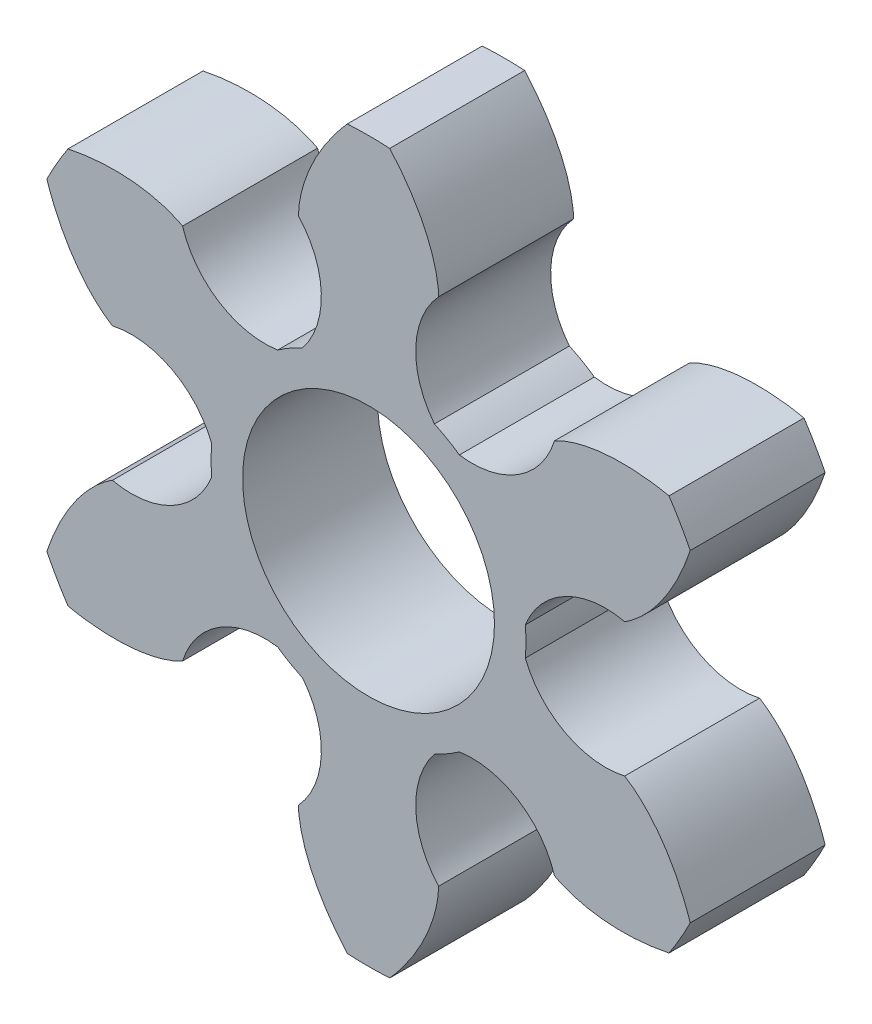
ISO-10303-21;
HEADER;
FILE_DESCRIPTION(('STEP AP214'),'2;1');
FILE_NAME('part.step','',(''),(''),'','','');
FILE_SCHEMA(('AUTOMOTIVE_DESIGN { 1 0 10303 214 1 1 1 1 }'));
ENDSEC;
DATA;
#1=APPLICATION_CONTEXT('core data for automotive mechanical design processes');
#2=APPLICATION_PROTOCOL_DEFINITION('international standard','automotive_design',2000,#1);
#3=PRODUCT_CONTEXT('',#1,'mechanical');
#4=PRODUCT('Part','Part','',(#3));
#5=PRODUCT_RELATED_PRODUCT_CATEGORY('part','',(#4));
#6=PRODUCT_DEFINITION_FORMATION('','',#4);
#7=PRODUCT_DEFINITION_CONTEXT('part definition',#1,'design');
#8=PRODUCT_DEFINITION('design','',#6,#7);
#9=PRODUCT_DEFINITION_SHAPE('','',#8);
#10=(LENGTH_UNIT() NAMED_UNIT(*) SI_UNIT(.MILLI.,.METRE.));
#11=(NAMED_UNIT(*) PLANE_ANGLE_UNIT() SI_UNIT($,.RADIAN.));
#12=(NAMED_UNIT(*) SI_UNIT($,.STERADIAN.) SOLID_ANGLE_UNIT());
#13=UNCERTAINTY_MEASURE_WITH_UNIT(LENGTH_MEASURE(1.E-05),#10,'distance_accuracy_value','');
#14=(GEOMETRIC_REPRESENTATION_CONTEXT(3) GLOBAL_UNCERTAINTY_ASSIGNED_CONTEXT((#13)) GLOBAL_UNIT_ASSIGNED_CONTEXT((#10,
#11,#12)) REPRESENTATION_CONTEXT('',''));
#15=CARTESIAN_POINT('',(0.,0.,0.));
#16=DIRECTION('',(0.,0.,1.));
#17=DIRECTION('',(1.,0.,0.));
#18=AXIS2_PLACEMENT_3D('',#15,#16,#17);
#19=CARTESIAN_POINT('',(0.,0.,-1.501));
#20=DIRECTION('',(0.,0.,1.));
#21=DIRECTION('',(1.,0.,0.));
#22=AXIS2_PLACEMENT_3D('',#19,#20,#21);
#23=CYLINDRICAL_SURFACE('',#22,3.5);
#24=DIRECTION('',(0.,0.,-1.));
#25=VECTOR('',#24,1.);
#26=CARTESIAN_POINT('',(1.46537455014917,-3.17847092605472,0.));
#27=LINE('',#26,#25);
#28=CARTESIAN_POINT('',(1.46537455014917,-3.17847092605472,-1.5));
#29=VERTEX_POINT('',#28);
#30=CARTESIAN_POINT('',(1.46537455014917,-3.17847092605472,1.5));
#31=VERTEX_POINT('',#30);
#32=EDGE_CURVE('E11',#29,#31,#27,.F.);
#33=ORIENTED_EDGE('',*,*,#32,.F.);
#34=CARTESIAN_POINT('',(0.,0.,-1.5));
#35=DIRECTION('',(0.,0.,1.));
#36=DIRECTION('',(1.,0.,0.));
#37=AXIS2_PLACEMENT_3D('',#34,#35,#36);
#38=CIRCLE('',#37,3.5);
#39=CARTESIAN_POINT('',(2.01994929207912,-2.85828704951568,-1.5));
#40=VERTEX_POINT('',#39);
#41=EDGE_CURVE('E636',#29,#40,#38,.T.);
#42=ORIENTED_EDGE('',*,*,#41,.T.);
#43=DIRECTION('',(0.,0.,-1.));
#44=VECTOR('',#43,1.);
#45=CARTESIAN_POINT('',(2.01994929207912,-2.85828704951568,0.));
#46=LINE('',#45,#44);
#47=CARTESIAN_POINT('',(2.01994929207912,-2.85828704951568,1.5));
#48=VERTEX_POINT('',#47);
#49=EDGE_CURVE('E644',#48,#40,#46,.T.);
#50=ORIENTED_EDGE('',*,*,#49,.F.);
#51=CARTESIAN_POINT('',(0.,0.,1.5));
#52=DIRECTION('',(0.,0.,1.));
#53=DIRECTION('',(1.,0.,0.));
#54=AXIS2_PLACEMENT_3D('',#51,#52,#53);
#55=CIRCLE('',#54,3.5);
#56=EDGE_CURVE('E643',#48,#31,#55,.F.);
#57=ORIENTED_EDGE('',*,*,#56,.T.);
#58=EDGE_LOOP('',(#33,#42,#50,#57));
#59=FACE_BOUND('',#58,.T.);
#60=ADVANCED_FACE('F390',(#59),#23,.T.);
#61=CARTESIAN_POINT('',(0.,0.,-1.501));
#62=DIRECTION('',(0.,0.,1.));
#63=DIRECTION('',(1.,0.,0.));
#64=AXIS2_PLACEMENT_3D('',#61,#62,#63);
#65=CYLINDRICAL_SURFACE('',#64,3.5);
#66=DIRECTION('',(0.,0.,-1.));
#67=VECTOR('',#66,1.);
#68=CARTESIAN_POINT('',(-2.01994929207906,-2.85828704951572,0.));
#69=LINE('',#68,#67);
#70=CARTESIAN_POINT('',(-2.01994929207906,-2.85828704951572,-1.5));
#71=VERTEX_POINT('',#70);
#72=CARTESIAN_POINT('',(-2.01994929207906,-2.85828704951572,1.5));
#73=VERTEX_POINT('',#72);
#74=EDGE_CURVE('E398',#71,#73,#69,.F.);
#75=ORIENTED_EDGE('',*,*,#74,.F.);
#76=CARTESIAN_POINT('',(0.,0.,-1.5));
#77=DIRECTION('',(0.,0.,1.));
#78=DIRECTION('',(1.,0.,0.));
#79=AXIS2_PLACEMENT_3D('',#76,#77,#78);
#80=CIRCLE('',#79,3.5);
#81=CARTESIAN_POINT('',(-1.4653745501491,-3.17847092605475,-1.5));
#82=VERTEX_POINT('',#81);
#83=EDGE_CURVE('E929',#71,#82,#80,.T.);
#84=ORIENTED_EDGE('',*,*,#83,.T.);
#85=DIRECTION('',(0.,0.,-1.));
#86=VECTOR('',#85,1.);
#87=CARTESIAN_POINT('',(-1.4653745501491,-3.17847092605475,0.));
#88=LINE('',#87,#86);
#89=CARTESIAN_POINT('',(-1.4653745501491,-3.17847092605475,1.5));
#90=VERTEX_POINT('',#89);
#91=EDGE_CURVE('E933',#90,#82,#88,.T.);
#92=ORIENTED_EDGE('',*,*,#91,.F.);
#93=CARTESIAN_POINT('',(0.,0.,1.5));
#94=DIRECTION('',(0.,0.,1.));
#95=DIRECTION('',(1.,0.,0.));
#96=AXIS2_PLACEMENT_3D('',#93,#94,#95);
#97=CIRCLE('',#96,3.5);
#98=EDGE_CURVE('E932',#90,#73,#97,.F.);
#99=ORIENTED_EDGE('',*,*,#98,.T.);
#100=EDGE_LOOP('',(#75,#84,#92,#99));
#101=FACE_BOUND('',#100,.T.);
#102=ADVANCED_FACE('F703',(#101),#65,.T.);
#103=CARTESIAN_POINT('',(0.,0.,-1.501));
#104=DIRECTION('',(0.,0.,1.));
#105=DIRECTION('',(1.,0.,0.));
#106=AXIS2_PLACEMENT_3D('',#103,#104,#105);
#107=CYLINDRICAL_SURFACE('',#106,3.5);
#108=DIRECTION('',(0.,0.,-1.));
#109=VECTOR('',#108,1.);
#110=CARTESIAN_POINT('',(-3.48532384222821,0.320183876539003,0.));
#111=LINE('',#110,#109);
#112=CARTESIAN_POINT('',(-3.48532384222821,0.320183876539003,-1.5));
#113=VERTEX_POINT('',#112);
#114=CARTESIAN_POINT('',(-3.48532384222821,0.320183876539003,1.5));
#115=VERTEX_POINT('',#114);
#116=EDGE_CURVE('E914',#113,#115,#111,.F.);
#117=ORIENTED_EDGE('',*,*,#116,.F.);
#118=CARTESIAN_POINT('',(0.,0.,-1.5));
#119=DIRECTION('',(0.,0.,1.));
#120=DIRECTION('',(1.,0.,0.));
#121=AXIS2_PLACEMENT_3D('',#118,#119,#120);
#122=CIRCLE('',#121,3.5);
#123=CARTESIAN_POINT('',(-3.48532384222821,-0.320183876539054,-1.5));
#124=VERTEX_POINT('',#123);
#125=EDGE_CURVE('E747',#113,#124,#122,.T.);
#126=ORIENTED_EDGE('',*,*,#125,.T.);
#127=DIRECTION('',(0.,0.,-1.));
#128=VECTOR('',#127,1.);
#129=CARTESIAN_POINT('',(-3.48532384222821,-0.320183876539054,0.));
#130=LINE('',#129,#128);
#131=CARTESIAN_POINT('',(-3.48532384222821,-0.320183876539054,1.5));
#132=VERTEX_POINT('',#131);
#133=EDGE_CURVE('E1113',#132,#124,#130,.T.);
#134=ORIENTED_EDGE('',*,*,#133,.F.);
#135=CARTESIAN_POINT('',(0.,0.,1.5));
#136=DIRECTION('',(0.,0.,1.));
#137=DIRECTION('',(1.,0.,0.));
#138=AXIS2_PLACEMENT_3D('',#135,#136,#137);
#139=CIRCLE('',#138,3.5);
#140=EDGE_CURVE('E721',#132,#115,#139,.F.);
#141=ORIENTED_EDGE('',*,*,#140,.T.);
#142=EDGE_LOOP('',(#117,#126,#134,#141));
#143=FACE_BOUND('',#142,.T.);
#144=ADVANCED_FACE('F777',(#143),#107,.T.);
#145=CARTESIAN_POINT('',(0.,0.,-1.501));
#146=DIRECTION('',(0.,0.,1.));
#147=DIRECTION('',(1.,0.,0.));
#148=AXIS2_PLACEMENT_3D('',#145,#146,#147);
#149=CYLINDRICAL_SURFACE('',#148,3.5);
#150=DIRECTION('',(0.,0.,-1.));
#151=VECTOR('',#150,1.);
#152=CARTESIAN_POINT('',(-1.46537455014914,3.17847092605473,0.));
#153=LINE('',#152,#151);
#154=CARTESIAN_POINT('',(-1.46537455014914,3.17847092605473,-1.5));
#155=VERTEX_POINT('',#154);
#156=CARTESIAN_POINT('',(-1.46537455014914,3.17847092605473,1.5));
#157=VERTEX_POINT('',#156);
#158=EDGE_CURVE('E911',#155,#157,#153,.F.);
#159=ORIENTED_EDGE('',*,*,#158,.F.);
#160=CARTESIAN_POINT('',(0.,0.,-1.5));
#161=DIRECTION('',(0.,0.,1.));
#162=DIRECTION('',(1.,0.,0.));
#163=AXIS2_PLACEMENT_3D('',#160,#161,#162);
#164=CIRCLE('',#163,3.5);
#165=CARTESIAN_POINT('',(-2.0199492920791,2.8582870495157,-1.5));
#166=VERTEX_POINT('',#165);
#167=EDGE_CURVE('E1065',#155,#166,#164,.T.);
#168=ORIENTED_EDGE('',*,*,#167,.T.);
#169=DIRECTION('',(0.,0.,-1.));
#170=VECTOR('',#169,1.);
#171=CARTESIAN_POINT('',(-2.0199492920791,2.8582870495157,0.));
#172=LINE('',#171,#170);
#173=CARTESIAN_POINT('',(-2.0199492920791,2.8582870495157,1.5));
#174=VERTEX_POINT('',#173);
#175=EDGE_CURVE('E1118',#174,#166,#172,.T.);
#176=ORIENTED_EDGE('',*,*,#175,.F.);
#177=CARTESIAN_POINT('',(0.,0.,1.5));
#178=DIRECTION('',(0.,0.,1.));
#179=DIRECTION('',(1.,0.,0.));
#180=AXIS2_PLACEMENT_3D('',#177,#178,#179);
#181=CIRCLE('',#180,3.5);
#182=EDGE_CURVE('E1090',#174,#157,#181,.F.);
#183=ORIENTED_EDGE('',*,*,#182,.T.);
#184=EDGE_LOOP('',(#159,#168,#176,#183));
#185=FACE_BOUND('',#184,.T.);
#186=ADVANCED_FACE('F785',(#185),#149,.T.);
#187=CARTESIAN_POINT('',(0.,0.,-1.501));
#188=DIRECTION('',(0.,0.,1.));
#189=DIRECTION('',(1.,0.,0.));
#190=AXIS2_PLACEMENT_3D('',#187,#188,#189);
#191=CYLINDRICAL_SURFACE('',#190,3.5);
#192=DIRECTION('',(0.,0.,-1.));
#193=VECTOR('',#192,1.);
#194=CARTESIAN_POINT('',(2.01994929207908,2.85828704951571,0.));
#195=LINE('',#194,#193);
#196=CARTESIAN_POINT('',(2.01994929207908,2.85828704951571,-1.5));
#197=VERTEX_POINT('',#196);
#198=CARTESIAN_POINT('',(2.01994929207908,2.85828704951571,1.5));
#199=VERTEX_POINT('',#198);
#200=EDGE_CURVE('E908',#197,#199,#195,.F.);
#201=ORIENTED_EDGE('',*,*,#200,.F.);
#202=CARTESIAN_POINT('',(0.,0.,-1.5));
#203=DIRECTION('',(0.,0.,1.));
#204=DIRECTION('',(1.,0.,0.));
#205=AXIS2_PLACEMENT_3D('',#202,#203,#204);
#206=CIRCLE('',#205,3.5);
#207=CARTESIAN_POINT('',(1.46537455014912,3.17847092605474,-1.5));
#208=VERTEX_POINT('',#207);
#209=EDGE_CURVE('E829',#197,#208,#206,.T.);
#210=ORIENTED_EDGE('',*,*,#209,.T.);
#211=DIRECTION('',(0.,0.,-1.));
#212=VECTOR('',#211,1.);
#213=CARTESIAN_POINT('',(1.46537455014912,3.17847092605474,0.));
#214=LINE('',#213,#212);
#215=CARTESIAN_POINT('',(1.46537455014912,3.17847092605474,1.5));
#216=VERTEX_POINT('',#215);
#217=EDGE_CURVE('E1121',#216,#208,#214,.T.);
#218=ORIENTED_EDGE('',*,*,#217,.F.);
#219=CARTESIAN_POINT('',(0.,0.,1.5));
#220=DIRECTION('',(0.,0.,1.));
#221=DIRECTION('',(1.,0.,0.));
#222=AXIS2_PLACEMENT_3D('',#219,#220,#221);
#223=CIRCLE('',#222,3.5);
#224=EDGE_CURVE('E803',#216,#199,#223,.F.);
#225=ORIENTED_EDGE('',*,*,#224,.T.);
#226=EDGE_LOOP('',(#201,#210,#218,#225));
#227=FACE_BOUND('',#226,.T.);
#228=ADVANCED_FACE('F693',(#227),#191,.T.);
#229=CARTESIAN_POINT('',(12.935120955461,9.07460445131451,-1.501));
#230=CARTESIAN_POINT('',(13.2013603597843,6.74919861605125,-1.501));
#231=CARTESIAN_POINT('',(13.7282708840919,2.14702182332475,-1.501));
#232=CARTESIAN_POINT('',(10.3208426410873,-3.09104486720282,-1.501));
#233=CARTESIAN_POINT('',(6.83203024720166,-4.5228695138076,-1.501));
#234=CARTESIAN_POINT('',(5.26245784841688,-4.51616311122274,-1.501));
#235=CARTESIAN_POINT('',(4.66850427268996,-4.40898569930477,-1.501));
#236=CARTESIAN_POINT('',(4.23683240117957,-4.25422911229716,-1.501));
#237=CARTESIAN_POINT('',(3.9154410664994,-4.06069716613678,-1.501));
#238=CARTESIAN_POINT('',(3.71950621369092,-3.82770085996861,-1.501));
#239=CARTESIAN_POINT('',(3.4544496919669,-3.56165604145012,-1.501));
#240=CARTESIAN_POINT('',(3.16706384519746,-3.26256380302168,-1.501));
#241=CARTESIAN_POINT('',(2.93086641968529,-3.01873254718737,-1.501));
#242=CARTESIAN_POINT('',(2.82534153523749,-2.91001268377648,-1.501));
#243=B_SPLINE_CURVE_WITH_KNOTS('',3,(#229,#230,#231,#232,#233,#234,#235,#236,#237,#238,#239,
#240,#241,#242),.UNSPECIFIED.,.F.,.F.,(4,1,1,1,1,1,1,1,1,1,1,4),(0.,0.278381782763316,
0.550941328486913,0.684998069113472,0.716244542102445,0.740547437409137,0.757906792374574,
0.771764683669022,0.78545880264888,0.794588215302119,0.817411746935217,0.835811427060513),.UNSPECIFIED.);
#244=DIRECTION('',(0.,0.,1.));
#245=VECTOR('',#244,1.);
#246=SURFACE_OF_LINEAR_EXTRUSION('',#243,#245);
#247=CARTESIAN_POINT('',(12.935120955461,9.07460445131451,1.5));
#248=CARTESIAN_POINT('',(13.2013603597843,6.74919861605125,1.5));
#249=CARTESIAN_POINT('',(13.7282708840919,2.14702182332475,1.5));
#250=CARTESIAN_POINT('',(10.3208426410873,-3.09104486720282,1.5));
#251=CARTESIAN_POINT('',(6.83203024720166,-4.5228695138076,1.5));
#252=CARTESIAN_POINT('',(5.26245784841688,-4.51616311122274,1.5));
#253=CARTESIAN_POINT('',(4.66850427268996,-4.40898569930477,1.5));
#254=CARTESIAN_POINT('',(4.23683240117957,-4.25422911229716,1.5));
#255=CARTESIAN_POINT('',(3.9154410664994,-4.06069716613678,1.5));
#256=CARTESIAN_POINT('',(3.71950621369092,-3.82770085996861,1.5));
#257=CARTESIAN_POINT('',(3.4544496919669,-3.56165604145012,1.5));
#258=CARTESIAN_POINT('',(3.16706384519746,-3.26256380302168,1.5));
#259=CARTESIAN_POINT('',(2.93086641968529,-3.01873254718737,1.5));
#260=CARTESIAN_POINT('',(2.82534153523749,-2.91001268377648,1.5));
#261=B_SPLINE_CURVE_WITH_KNOTS('',3,(#247,#248,#249,#250,#251,#252,#253,#254,#255,#256,#257,
#258,#259,#260),.UNSPECIFIED.,.F.,.F.,(4,1,1,1,1,1,1,1,1,1,1,4),(0.,0.278381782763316,
0.550941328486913,0.684998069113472,0.716244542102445,0.740547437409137,0.757906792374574,
0.771764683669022,0.78545880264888,0.794588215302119,0.817411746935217,0.835811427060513),.UNSPECIFIED.);
#262=CARTESIAN_POINT('',(6.68043559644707,-4.40133846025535,1.5));
#263=VERTEX_POINT('',#262);
#264=CARTESIAN_POINT('',(4.1343249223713,-4.18748492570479,1.5));
#265=VERTEX_POINT('',#264);
#266=EDGE_CURVE('E645',#263,#265,#261,.T.);
#267=ORIENTED_EDGE('',*,*,#266,.T.);
#268=DIRECTION('',(0.,0.,1.));
#269=VECTOR('',#268,1.);
#270=CARTESIAN_POINT('',(4.1343249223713,-4.18748492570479,-1.5));
#271=LINE('',#270,#269);
#272=CARTESIAN_POINT('',(4.1343249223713,-4.18748492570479,-1.5));
#273=VERTEX_POINT('',#272);
#274=EDGE_CURVE('E1131',#273,#265,#271,.T.);
#275=ORIENTED_EDGE('',*,*,#274,.F.);
#276=CARTESIAN_POINT('',(12.935120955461,9.07460445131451,-1.5));
#277=CARTESIAN_POINT('',(13.2013603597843,6.74919861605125,-1.5));
#278=CARTESIAN_POINT('',(13.7282708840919,2.14702182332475,-1.5));
#279=CARTESIAN_POINT('',(10.3208426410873,-3.09104486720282,-1.5));
#280=CARTESIAN_POINT('',(6.83203024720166,-4.5228695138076,-1.5));
#281=CARTESIAN_POINT('',(5.26245784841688,-4.51616311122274,-1.5));
#282=CARTESIAN_POINT('',(4.66850427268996,-4.40898569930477,-1.5));
#283=CARTESIAN_POINT('',(4.23683240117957,-4.25422911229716,-1.5));
#284=CARTESIAN_POINT('',(3.9154410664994,-4.06069716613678,-1.5));
#285=CARTESIAN_POINT('',(3.71950621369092,-3.82770085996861,-1.5));
#286=CARTESIAN_POINT('',(3.4544496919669,-3.56165604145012,-1.5));
#287=CARTESIAN_POINT('',(3.16706384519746,-3.26256380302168,-1.5));
#288=CARTESIAN_POINT('',(2.93086641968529,-3.01873254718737,-1.5));
#289=CARTESIAN_POINT('',(2.82534153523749,-2.91001268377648,-1.5));
#290=B_SPLINE_CURVE_WITH_KNOTS('',3,(#276,#277,#278,#279,#280,#281,#282,#283,#284,#285,#286,
#287,#288,#289),.UNSPECIFIED.,.F.,.F.,(4,1,1,1,1,1,1,1,1,1,1,4),(0.,0.278381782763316,
0.550941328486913,0.684998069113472,0.716244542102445,0.740547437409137,0.757906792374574,
0.771764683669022,0.78545880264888,0.794588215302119,0.817411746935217,0.835811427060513),.UNSPECIFIED.);
#291=CARTESIAN_POINT('',(6.68043559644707,-4.40133846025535,-1.5));
#292=VERTEX_POINT('',#291);
#293=EDGE_CURVE('E672',#273,#292,#290,.F.);
#294=ORIENTED_EDGE('',*,*,#293,.T.);
#295=DIRECTION('',(0.,0.,1.));
#296=VECTOR('',#295,1.);
#297=CARTESIAN_POINT('',(6.68043559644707,-4.40133846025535,-1.501));
#298=LINE('',#297,#296);
#299=EDGE_CURVE('E663',#292,#263,#298,.T.);
#300=ORIENTED_EDGE('',*,*,#299,.T.);
#301=EDGE_LOOP('',(#267,#275,#294,#300));
#302=FACE_BOUND('',#301,.T.);
#303=ADVANCED_FACE('F688',(#302),#246,.F.);
#304=CARTESIAN_POINT('',(14.3263984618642,-6.66484112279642,-1.501));
#305=CARTESIAN_POINT('',(12.4456576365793,-8.05811412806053,-1.501));
#306=CARTESIAN_POINT('',(8.72351088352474,-10.8155204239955,-1.501));
#307=CARTESIAN_POINT('',(2.48349794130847,-10.4836343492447,-1.501));
#308=CARTESIAN_POINT('',(-0.500904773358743,-8.17814651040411,-1.501));
#309=CARTESIAN_POINT('',(-1.27988305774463,-6.81550373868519,-1.501));
#310=CARTESIAN_POINT('',(-1.48404148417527,-6.24753614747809,-1.501));
#311=CARTESIAN_POINT('',(-1.56585428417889,-5.7963190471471,-1.501));
#312=CARTESIAN_POINT('',(-1.55894636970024,-5.4212200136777,-1.501));
#313=CARTESIAN_POINT('',(-1.45513307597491,-5.13503730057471,-1.501));
#314=CARTESIAN_POINT('',(-1.35725976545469,-4.77246921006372,-1.501));
#315=CARTESIAN_POINT('',(-1.24193121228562,-4.37403964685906,-1.501));
#316=CARTESIAN_POINT('',(-1.14886586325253,-4.04757104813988,-1.501));
#317=CARTESIAN_POINT('',(-1.10747414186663,-3.90182388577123,-1.501));
#318=B_SPLINE_CURVE_WITH_KNOTS('',3,(#304,#305,#306,#307,#308,#309,#310,#311,#312,#313,#314,
#315,#316,#317),.UNSPECIFIED.,.F.,.F.,(4,1,1,1,1,1,1,1,1,1,1,4),(0.,0.278381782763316,
0.550941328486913,0.684998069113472,0.716244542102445,0.740547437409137,0.757906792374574,
0.771764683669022,0.78545880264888,0.794588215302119,0.817411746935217,0.835811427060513),.UNSPECIFIED.);
#319=DIRECTION('',(0.,0.,1.));
#320=VECTOR('',#319,1.);
#321=SURFACE_OF_LINEAR_EXTRUSION('',#318,#320);
#322=CARTESIAN_POINT('',(14.3263984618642,-6.66484112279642,1.5));
#323=CARTESIAN_POINT('',(12.4456576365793,-8.05811412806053,1.5));
#324=CARTESIAN_POINT('',(8.72351088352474,-10.8155204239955,1.5));
#325=CARTESIAN_POINT('',(2.48349794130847,-10.4836343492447,1.5));
#326=CARTESIAN_POINT('',(-0.500904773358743,-8.17814651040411,1.5));
#327=CARTESIAN_POINT('',(-1.27988305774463,-6.81550373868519,1.5));
#328=CARTESIAN_POINT('',(-1.48404148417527,-6.24753614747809,1.5));
#329=CARTESIAN_POINT('',(-1.56585428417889,-5.7963190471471,1.5));
#330=CARTESIAN_POINT('',(-1.55894636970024,-5.4212200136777,1.5));
#331=CARTESIAN_POINT('',(-1.45513307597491,-5.13503730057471,1.5));
#332=CARTESIAN_POINT('',(-1.35725976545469,-4.77246921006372,1.5));
#333=CARTESIAN_POINT('',(-1.24193121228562,-4.37403964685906,1.5));
#334=CARTESIAN_POINT('',(-1.14886586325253,-4.04757104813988,1.5));
#335=CARTESIAN_POINT('',(-1.10747414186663,-3.90182388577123,1.5));
#336=B_SPLINE_CURVE_WITH_KNOTS('',3,(#322,#323,#324,#325,#326,#327,#328,#329,#330,#331,#332,
#333,#334,#335),.UNSPECIFIED.,.F.,.F.,(4,1,1,1,1,1,1,1,1,1,1,4),(0.,0.278381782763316,
0.550941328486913,0.684998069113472,0.716244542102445,0.740547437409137,0.757906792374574,
0.771764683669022,0.78545880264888,0.794588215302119,0.817411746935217,0.835811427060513),.UNSPECIFIED.);
#337=CARTESIAN_POINT('',(-0.471453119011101,-7.98609616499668,1.5));
#338=VERTEX_POINT('',#337);
#339=CARTESIAN_POINT('',(-1.5593058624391,-5.67417287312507,1.5));
#340=VERTEX_POINT('',#339);
#341=EDGE_CURVE('E935',#338,#340,#336,.T.);
#342=ORIENTED_EDGE('',*,*,#341,.T.);
#343=DIRECTION('',(0.,0.,1.));
#344=VECTOR('',#343,1.);
#345=CARTESIAN_POINT('',(-1.5593058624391,-5.67417287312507,-1.5));
#346=LINE('',#345,#344);
#347=CARTESIAN_POINT('',(-1.5593058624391,-5.67417287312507,-1.5));
#348=VERTEX_POINT('',#347);
#349=EDGE_CURVE('E1140',#348,#340,#346,.T.);
#350=ORIENTED_EDGE('',*,*,#349,.F.);
#351=CARTESIAN_POINT('',(14.3263984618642,-6.66484112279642,-1.5));
#352=CARTESIAN_POINT('',(12.4456576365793,-8.05811412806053,-1.5));
#353=CARTESIAN_POINT('',(8.72351088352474,-10.8155204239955,-1.5));
#354=CARTESIAN_POINT('',(2.48349794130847,-10.4836343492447,-1.5));
#355=CARTESIAN_POINT('',(-0.500904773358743,-8.17814651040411,-1.5));
#356=CARTESIAN_POINT('',(-1.27988305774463,-6.81550373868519,-1.5));
#357=CARTESIAN_POINT('',(-1.48404148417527,-6.24753614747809,-1.5));
#358=CARTESIAN_POINT('',(-1.56585428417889,-5.7963190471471,-1.5));
#359=CARTESIAN_POINT('',(-1.55894636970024,-5.4212200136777,-1.5));
#360=CARTESIAN_POINT('',(-1.45513307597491,-5.13503730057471,-1.5));
#361=CARTESIAN_POINT('',(-1.35725976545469,-4.77246921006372,-1.5));
#362=CARTESIAN_POINT('',(-1.24193121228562,-4.37403964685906,-1.5));
#363=CARTESIAN_POINT('',(-1.14886586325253,-4.04757104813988,-1.5));
#364=CARTESIAN_POINT('',(-1.10747414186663,-3.90182388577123,-1.5));
#365=B_SPLINE_CURVE_WITH_KNOTS('',3,(#351,#352,#353,#354,#355,#356,#357,#358,#359,#360,#361,
#362,#363,#364),.UNSPECIFIED.,.F.,.F.,(4,1,1,1,1,1,1,1,1,1,1,4),(0.,0.278381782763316,
0.550941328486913,0.684998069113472,0.716244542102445,0.740547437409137,0.757906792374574,
0.771764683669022,0.78545880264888,0.794588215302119,0.817411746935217,0.835811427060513),.UNSPECIFIED.);
#366=CARTESIAN_POINT('',(-0.471453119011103,-7.98609616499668,-1.5));
#367=VERTEX_POINT('',#366);
#368=EDGE_CURVE('E714',#348,#367,#365,.F.);
#369=ORIENTED_EDGE('',*,*,#368,.T.);
#370=DIRECTION('',(0.,0.,1.));
#371=VECTOR('',#370,1.);
#372=CARTESIAN_POINT('',(-0.471453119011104,-7.98609616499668,-1.501));
#373=LINE('',#372,#371);
#374=EDGE_CURVE('E951',#367,#338,#373,.T.);
#375=ORIENTED_EDGE('',*,*,#374,.T.);
#376=EDGE_LOOP('',(#342,#350,#369,#375));
#377=FACE_BOUND('',#376,.T.);
#378=ADVANCED_FACE('F692',(#377),#321,.F.);
#379=CARTESIAN_POINT('',(1.39127750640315,-15.7394455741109,-1.501));
#380=CARTESIAN_POINT('',(-0.755702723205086,-14.8073127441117,-1.501));
#381=CARTESIAN_POINT('',(-5.00476000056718,-12.9625422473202,-1.501));
#382=CARTESIAN_POINT('',(-7.83734469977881,-7.3925894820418,-1.501));
#383=CARTESIAN_POINT('',(-7.3329350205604,-3.65527699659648,-1.501));
#384=CARTESIAN_POINT('',(-6.54234090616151,-2.29934062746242,-1.501));
#385=CARTESIAN_POINT('',(-6.15254575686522,-1.83855044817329,-1.501));
#386=CARTESIAN_POINT('',(-5.80268668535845,-1.54208993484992,-1.501));
#387=CARTESIAN_POINT('',(-5.47438743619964,-1.3605228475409,-1.501));
#388=CARTESIAN_POINT('',(-5.17463928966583,-1.30733644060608,-1.501));
#389=CARTESIAN_POINT('',(-4.81170945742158,-1.21081316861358,-1.501));
#390=CARTESIAN_POINT('',(-4.40899505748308,-1.11147584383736,-1.501));
#391=CARTESIAN_POINT('',(-4.07973228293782,-1.0288385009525,-1.501));
#392=CARTESIAN_POINT('',(-3.93281567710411,-0.99181120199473,-1.501));
#393=B_SPLINE_CURVE_WITH_KNOTS('',3,(#379,#380,#381,#382,#383,#384,#385,#386,#387,#388,#389,
#390,#391,#392),.UNSPECIFIED.,.F.,.F.,(4,1,1,1,1,1,1,1,1,1,1,4),(0.,0.278381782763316,
0.550941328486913,0.684998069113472,0.716244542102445,0.740547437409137,0.757906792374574,
0.771764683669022,0.78545880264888,0.794588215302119,0.817411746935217,0.835811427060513),.UNSPECIFIED.);
#394=DIRECTION('',(0.,0.,1.));
#395=VECTOR('',#394,1.);
#396=SURFACE_OF_LINEAR_EXTRUSION('',#393,#395);
#397=CARTESIAN_POINT('',(1.39127750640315,-15.7394455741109,1.5));
#398=CARTESIAN_POINT('',(-0.755702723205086,-14.8073127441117,1.5));
#399=CARTESIAN_POINT('',(-5.00476000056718,-12.9625422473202,1.5));
#400=CARTESIAN_POINT('',(-7.83734469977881,-7.3925894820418,1.5));
#401=CARTESIAN_POINT('',(-7.3329350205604,-3.65527699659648,1.5));
#402=CARTESIAN_POINT('',(-6.54234090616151,-2.29934062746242,1.5));
#403=CARTESIAN_POINT('',(-6.15254575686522,-1.83855044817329,1.5));
#404=CARTESIAN_POINT('',(-5.80268668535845,-1.54208993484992,1.5));
#405=CARTESIAN_POINT('',(-5.47438743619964,-1.3605228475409,1.5));
#406=CARTESIAN_POINT('',(-5.17463928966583,-1.30733644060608,1.5));
#407=CARTESIAN_POINT('',(-4.81170945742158,-1.21081316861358,1.5));
#408=CARTESIAN_POINT('',(-4.40899505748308,-1.11147584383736,1.5));
#409=CARTESIAN_POINT('',(-4.07973228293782,-1.0288385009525,1.5));
#410=CARTESIAN_POINT('',(-3.93281567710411,-0.99181120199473,1.5));
#411=B_SPLINE_CURVE_WITH_KNOTS('',3,(#397,#398,#399,#400,#401,#402,#403,#404,#405,#406,#407,
#408,#409,#410),.UNSPECIFIED.,.F.,.F.,(4,1,1,1,1,1,1,1,1,1,1,4),(0.,0.278381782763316,
0.550941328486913,0.684998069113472,0.716244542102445,0.740547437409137,0.757906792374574,
0.771764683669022,0.78545880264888,0.794588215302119,0.817411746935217,0.835811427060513),.UNSPECIFIED.);
#412=CARTESIAN_POINT('',(-7.15188871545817,-3.5847577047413,1.5));
#413=VERTEX_POINT('',#412);
#414=CARTESIAN_POINT('',(-5.6936307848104,-1.48668794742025,1.5));
#415=VERTEX_POINT('',#414);
#416=EDGE_CURVE('E728',#413,#415,#411,.T.);
#417=ORIENTED_EDGE('',*,*,#416,.T.);
#418=DIRECTION('',(0.,0.,1.));
#419=VECTOR('',#418,1.);
#420=CARTESIAN_POINT('',(-5.6936307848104,-1.48668794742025,-1.5));
#421=LINE('',#420,#419);
#422=CARTESIAN_POINT('',(-5.6936307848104,-1.48668794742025,-1.5));
#423=VERTEX_POINT('',#422);
#424=EDGE_CURVE('E1102',#423,#415,#421,.T.);
#425=ORIENTED_EDGE('',*,*,#424,.F.);
#426=CARTESIAN_POINT('',(1.39127750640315,-15.7394455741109,-1.5));
#427=CARTESIAN_POINT('',(-0.755702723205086,-14.8073127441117,-1.5));
#428=CARTESIAN_POINT('',(-5.00476000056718,-12.9625422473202,-1.5));
#429=CARTESIAN_POINT('',(-7.83734469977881,-7.3925894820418,-1.5));
#430=CARTESIAN_POINT('',(-7.3329350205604,-3.65527699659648,-1.5));
#431=CARTESIAN_POINT('',(-6.54234090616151,-2.29934062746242,-1.5));
#432=CARTESIAN_POINT('',(-6.15254575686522,-1.83855044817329,-1.5));
#433=CARTESIAN_POINT('',(-5.80268668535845,-1.54208993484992,-1.5));
#434=CARTESIAN_POINT('',(-5.47438743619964,-1.3605228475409,-1.5));
#435=CARTESIAN_POINT('',(-5.17463928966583,-1.30733644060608,-1.5));
#436=CARTESIAN_POINT('',(-4.81170945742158,-1.21081316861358,-1.5));
#437=CARTESIAN_POINT('',(-4.40899505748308,-1.11147584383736,-1.5));
#438=CARTESIAN_POINT('',(-4.07973228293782,-1.0288385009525,-1.5));
#439=CARTESIAN_POINT('',(-3.93281567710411,-0.99181120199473,-1.5));
#440=B_SPLINE_CURVE_WITH_KNOTS('',3,(#426,#427,#428,#429,#430,#431,#432,#433,#434,#435,#436,
#437,#438,#439),.UNSPECIFIED.,.F.,.F.,(4,1,1,1,1,1,1,1,1,1,1,4),(0.,0.278381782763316,
0.550941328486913,0.684998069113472,0.716244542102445,0.740547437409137,0.757906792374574,
0.771764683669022,0.78545880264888,0.794588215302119,0.817411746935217,0.835811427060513),.UNSPECIFIED.);
#441=CARTESIAN_POINT('',(-7.15188871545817,-3.5847577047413,-1.5));
#442=VERTEX_POINT('',#441);
#443=EDGE_CURVE('E755',#423,#442,#440,.F.);
#444=ORIENTED_EDGE('',*,*,#443,.T.);
#445=DIRECTION('',(0.,0.,1.));
#446=VECTOR('',#445,1.);
#447=CARTESIAN_POINT('',(-7.15188871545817,-3.5847577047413,-1.501));
#448=LINE('',#447,#446);
#449=EDGE_CURVE('E740',#442,#413,#448,.T.);
#450=ORIENTED_EDGE('',*,*,#449,.T.);
#451=EDGE_LOOP('',(#417,#425,#444,#450));
#452=FACE_BOUND('',#451,.T.);
#453=ADVANCED_FACE('F771',(#452),#396,.F.);
#454=CARTESIAN_POINT('',(-12.935120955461,-9.07460445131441,-1.501));
#455=CARTESIAN_POINT('',(-13.2013603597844,-6.74919861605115,-1.501));
#456=CARTESIAN_POINT('',(-13.7282708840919,-2.14702182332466,-1.501));
#457=CARTESIAN_POINT('',(-10.3208426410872,3.0910448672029,-1.501));
#458=CARTESIAN_POINT('',(-6.83203024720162,4.52286951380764,-1.501));
#459=CARTESIAN_POINT('',(-5.26245784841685,4.51616311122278,-1.501));
#460=CARTESIAN_POINT('',(-4.66850427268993,4.40898569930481,-1.501));
#461=CARTESIAN_POINT('',(-4.23683240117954,4.25422911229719,-1.501));
#462=CARTESIAN_POINT('',(-3.91544106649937,4.06069716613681,-1.501));
#463=CARTESIAN_POINT('',(-3.7195062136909,3.82770085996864,-1.501));
#464=CARTESIAN_POINT('',(-3.45444969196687,3.56165604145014,-1.501));
#465=CARTESIAN_POINT('',(-3.16706384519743,3.2625638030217,-1.501));
#466=CARTESIAN_POINT('',(-2.93086641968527,3.01873254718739,-1.501));
#467=CARTESIAN_POINT('',(-2.82534153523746,2.9100126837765,-1.501));
#468=B_SPLINE_CURVE_WITH_KNOTS('',3,(#454,#455,#456,#457,#458,#459,#460,#461,#462,#463,#464,
#465,#466,#467),.UNSPECIFIED.,.F.,.F.,(4,1,1,1,1,1,1,1,1,1,1,4),(0.,0.278381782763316,
0.550941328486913,0.684998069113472,0.716244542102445,0.740547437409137,0.757906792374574,
0.771764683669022,0.78545880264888,0.794588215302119,0.817411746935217,0.835811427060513),.UNSPECIFIED.);
#469=DIRECTION('',(0.,0.,1.));
#470=VECTOR('',#469,1.);
#471=SURFACE_OF_LINEAR_EXTRUSION('',#468,#470);
#472=CARTESIAN_POINT('',(-12.935120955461,-9.07460445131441,1.5));
#473=CARTESIAN_POINT('',(-13.2013603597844,-6.74919861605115,1.5));
#474=CARTESIAN_POINT('',(-13.7282708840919,-2.14702182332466,1.5));
#475=CARTESIAN_POINT('',(-10.3208426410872,3.0910448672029,1.5));
#476=CARTESIAN_POINT('',(-6.83203024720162,4.52286951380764,1.5));
#477=CARTESIAN_POINT('',(-5.26245784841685,4.51616311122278,1.5));
#478=CARTESIAN_POINT('',(-4.66850427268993,4.40898569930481,1.5));
#479=CARTESIAN_POINT('',(-4.23683240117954,4.25422911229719,1.5));
#480=CARTESIAN_POINT('',(-3.91544106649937,4.06069716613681,1.5));
#481=CARTESIAN_POINT('',(-3.7195062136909,3.82770085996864,1.5));
#482=CARTESIAN_POINT('',(-3.45444969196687,3.56165604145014,1.5));
#483=CARTESIAN_POINT('',(-3.16706384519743,3.2625638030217,1.5));
#484=CARTESIAN_POINT('',(-2.93086641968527,3.01873254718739,1.5));
#485=CARTESIAN_POINT('',(-2.82534153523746,2.9100126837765,1.5));
#486=B_SPLINE_CURVE_WITH_KNOTS('',3,(#472,#473,#474,#475,#476,#477,#478,#479,#480,#481,#482,
#483,#484,#485),.UNSPECIFIED.,.F.,.F.,(4,1,1,1,1,1,1,1,1,1,1,4),(0.,0.278381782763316,
0.550941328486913,0.684998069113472,0.716244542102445,0.740547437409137,0.757906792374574,
0.771764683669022,0.78545880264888,0.794588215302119,0.817411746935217,0.835811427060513),.UNSPECIFIED.);
#487=CARTESIAN_POINT('',(-6.68043559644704,4.4013384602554,1.5));
#488=VERTEX_POINT('',#487);
#489=CARTESIAN_POINT('',(-4.13432492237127,4.18748492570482,1.5));
#490=VERTEX_POINT('',#489);
#491=EDGE_CURVE('E1082',#488,#490,#486,.T.);
#492=ORIENTED_EDGE('',*,*,#491,.T.);
#493=DIRECTION('',(0.,0.,1.));
#494=VECTOR('',#493,1.);
#495=CARTESIAN_POINT('',(-4.13432492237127,4.18748492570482,-1.5));
#496=LINE('',#495,#494);
#497=CARTESIAN_POINT('',(-4.13432492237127,4.18748492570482,-1.5));
#498=VERTEX_POINT('',#497);
#499=EDGE_CURVE('E1158',#498,#490,#496,.T.);
#500=ORIENTED_EDGE('',*,*,#499,.F.);
#501=CARTESIAN_POINT('',(-12.935120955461,-9.07460445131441,-1.5));
#502=CARTESIAN_POINT('',(-13.2013603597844,-6.74919861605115,-1.5));
#503=CARTESIAN_POINT('',(-13.7282708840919,-2.14702182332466,-1.5));
#504=CARTESIAN_POINT('',(-10.3208426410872,3.0910448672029,-1.5));
#505=CARTESIAN_POINT('',(-6.83203024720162,4.52286951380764,-1.5));
#506=CARTESIAN_POINT('',(-5.26245784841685,4.51616311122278,-1.5));
#507=CARTESIAN_POINT('',(-4.66850427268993,4.40898569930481,-1.5));
#508=CARTESIAN_POINT('',(-4.23683240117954,4.25422911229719,-1.5));
#509=CARTESIAN_POINT('',(-3.91544106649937,4.06069716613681,-1.5));
#510=CARTESIAN_POINT('',(-3.7195062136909,3.82770085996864,-1.5));
#511=CARTESIAN_POINT('',(-3.45444969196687,3.56165604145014,-1.5));
#512=CARTESIAN_POINT('',(-3.16706384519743,3.2625638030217,-1.5));
#513=CARTESIAN_POINT('',(-2.93086641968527,3.01873254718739,-1.5));
#514=CARTESIAN_POINT('',(-2.82534153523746,2.9100126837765,-1.5));
#515=B_SPLINE_CURVE_WITH_KNOTS('',3,(#501,#502,#503,#504,#505,#506,#507,#508,#509,#510,#511,
#512,#513,#514),.UNSPECIFIED.,.F.,.F.,(4,1,1,1,1,1,1,1,1,1,1,4),(0.,0.278381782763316,
0.550941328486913,0.684998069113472,0.716244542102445,0.740547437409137,0.757906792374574,
0.771764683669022,0.78545880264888,0.794588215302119,0.817411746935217,0.835811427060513),.UNSPECIFIED.);
#516=CARTESIAN_POINT('',(-6.68043559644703,4.40133846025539,-1.5));
#517=VERTEX_POINT('',#516);
#518=EDGE_CURVE('E796',#498,#517,#515,.F.);
#519=ORIENTED_EDGE('',*,*,#518,.T.);
#520=DIRECTION('',(0.,0.,1.));
#521=VECTOR('',#520,1.);
#522=CARTESIAN_POINT('',(-6.68043559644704,4.40133846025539,-1.501));
#523=LINE('',#522,#521);
#524=EDGE_CURVE('E1076',#517,#488,#523,.T.);
#525=ORIENTED_EDGE('',*,*,#524,.T.);
#526=EDGE_LOOP('',(#492,#500,#519,#525));
#527=FACE_BOUND('',#526,.T.);
#528=ADVANCED_FACE('F775',(#527),#471,.F.);
#529=CARTESIAN_POINT('',(-14.3263984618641,6.66484112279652,-1.501));
#530=CARTESIAN_POINT('',(-12.4456576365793,8.05811412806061,-1.501));
#531=CARTESIAN_POINT('',(-8.72351088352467,10.8155204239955,-1.501));
#532=CARTESIAN_POINT('',(-2.48349794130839,10.4836343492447,-1.501));
#533=CARTESIAN_POINT('',(0.5009047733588,8.1781465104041,-1.501));
#534=CARTESIAN_POINT('',(1.27988305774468,6.81550373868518,-1.501));
#535=CARTESIAN_POINT('',(1.48404148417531,6.24753614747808,-1.501));
#536=CARTESIAN_POINT('',(1.56585428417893,5.79631904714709,-1.501));
#537=CARTESIAN_POINT('',(1.55894636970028,5.42122001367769,-1.501));
#538=CARTESIAN_POINT('',(1.45513307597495,5.1350373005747,-1.501));
#539=CARTESIAN_POINT('',(1.35725976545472,4.77246921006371,-1.501));
#540=CARTESIAN_POINT('',(1.24193121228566,4.37403964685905,-1.501));
#541=CARTESIAN_POINT('',(1.14886586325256,4.04757104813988,-1.501));
#542=CARTESIAN_POINT('',(1.10747414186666,3.90182388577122,-1.501));
#543=B_SPLINE_CURVE_WITH_KNOTS('',3,(#529,#530,#531,#532,#533,#534,#535,#536,#537,#538,#539,
#540,#541,#542),.UNSPECIFIED.,.F.,.F.,(4,1,1,1,1,1,1,1,1,1,1,4),(0.,0.278381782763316,
0.550941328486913,0.684998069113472,0.716244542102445,0.740547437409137,0.757906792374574,
0.771764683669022,0.78545880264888,0.794588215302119,0.817411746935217,0.835811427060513),.UNSPECIFIED.);
#544=DIRECTION('',(0.,0.,1.));
#545=VECTOR('',#544,1.);
#546=SURFACE_OF_LINEAR_EXTRUSION('',#543,#545);
#547=CARTESIAN_POINT('',(-14.3263984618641,6.66484112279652,1.5));
#548=CARTESIAN_POINT('',(-12.4456576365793,8.05811412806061,1.5));
#549=CARTESIAN_POINT('',(-8.72351088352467,10.8155204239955,1.5));
#550=CARTESIAN_POINT('',(-2.48349794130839,10.4836343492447,1.5));
#551=CARTESIAN_POINT('',(0.5009047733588,8.1781465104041,1.5));
#552=CARTESIAN_POINT('',(1.27988305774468,6.81550373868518,1.5));
#553=CARTESIAN_POINT('',(1.48404148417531,6.24753614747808,1.5));
#554=CARTESIAN_POINT('',(1.56585428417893,5.79631904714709,1.5));
#555=CARTESIAN_POINT('',(1.55894636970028,5.42122001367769,1.5));
#556=CARTESIAN_POINT('',(1.45513307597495,5.1350373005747,1.5));
#557=CARTESIAN_POINT('',(1.35725976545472,4.77246921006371,1.5));
#558=CARTESIAN_POINT('',(1.24193121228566,4.37403964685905,1.5));
#559=CARTESIAN_POINT('',(1.14886586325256,4.04757104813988,1.5));
#560=CARTESIAN_POINT('',(1.10747414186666,3.90182388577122,1.5));
#561=B_SPLINE_CURVE_WITH_KNOTS('',3,(#547,#548,#549,#550,#551,#552,#553,#554,#555,#556,#557,
#558,#559,#560),.UNSPECIFIED.,.F.,.F.,(4,1,1,1,1,1,1,1,1,1,1,4),(0.,0.278381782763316,
0.550941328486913,0.684998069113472,0.716244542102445,0.740547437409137,0.757906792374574,
0.771764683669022,0.78545880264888,0.794588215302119,0.817411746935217,0.835811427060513),.UNSPECIFIED.);
#562=CARTESIAN_POINT('',(0.471453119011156,7.98609616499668,1.5));
#563=VERTEX_POINT('',#562);
#564=CARTESIAN_POINT('',(1.55930586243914,5.67417287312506,1.5));
#565=VERTEX_POINT('',#564);
#566=EDGE_CURVE('E810',#563,#565,#561,.T.);
#567=ORIENTED_EDGE('',*,*,#566,.T.);
#568=DIRECTION('',(0.,0.,1.));
#569=VECTOR('',#568,1.);
#570=CARTESIAN_POINT('',(1.55930586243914,5.67417287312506,-1.5));
#571=LINE('',#570,#569);
#572=CARTESIAN_POINT('',(1.55930586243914,5.67417287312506,-1.5));
#573=VERTEX_POINT('',#572);
#574=EDGE_CURVE('E646',#573,#565,#571,.T.);
#575=ORIENTED_EDGE('',*,*,#574,.F.);
#576=CARTESIAN_POINT('',(-14.3263984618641,6.66484112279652,-1.5));
#577=CARTESIAN_POINT('',(-12.4456576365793,8.05811412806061,-1.5));
#578=CARTESIAN_POINT('',(-8.72351088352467,10.8155204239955,-1.5));
#579=CARTESIAN_POINT('',(-2.48349794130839,10.4836343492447,-1.5));
#580=CARTESIAN_POINT('',(0.5009047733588,8.1781465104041,-1.5));
#581=CARTESIAN_POINT('',(1.27988305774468,6.81550373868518,-1.5));
#582=CARTESIAN_POINT('',(1.48404148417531,6.24753614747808,-1.5));
#583=CARTESIAN_POINT('',(1.56585428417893,5.79631904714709,-1.5));
#584=CARTESIAN_POINT('',(1.55894636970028,5.42122001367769,-1.5));
#585=CARTESIAN_POINT('',(1.45513307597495,5.1350373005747,-1.5));
#586=CARTESIAN_POINT('',(1.35725976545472,4.77246921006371,-1.5));
#587=CARTESIAN_POINT('',(1.24193121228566,4.37403964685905,-1.5));
#588=CARTESIAN_POINT('',(1.14886586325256,4.04757104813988,-1.5));
#589=CARTESIAN_POINT('',(1.10747414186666,3.90182388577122,-1.5));
#590=B_SPLINE_CURVE_WITH_KNOTS('',3,(#576,#577,#578,#579,#580,#581,#582,#583,#584,#585,#586,
#587,#588,#589),.UNSPECIFIED.,.F.,.F.,(4,1,1,1,1,1,1,1,1,1,1,4),(0.,0.278381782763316,
0.550941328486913,0.684998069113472,0.716244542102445,0.740547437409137,0.757906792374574,
0.771764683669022,0.78545880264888,0.794588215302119,0.817411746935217,0.835811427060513),.UNSPECIFIED.);
#591=CARTESIAN_POINT('',(0.471453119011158,7.98609616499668,-1.5));
#592=VERTEX_POINT('',#591);
#593=EDGE_CURVE('E837',#573,#592,#590,.F.);
#594=ORIENTED_EDGE('',*,*,#593,.T.);
#595=DIRECTION('',(0.,0.,1.));
#596=VECTOR('',#595,1.);
#597=CARTESIAN_POINT('',(0.471453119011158,7.98609616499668,-1.501));
#598=LINE('',#597,#596);
#599=EDGE_CURVE('E822',#592,#563,#598,.T.);
#600=ORIENTED_EDGE('',*,*,#599,.T.);
#601=EDGE_LOOP('',(#567,#575,#594,#600));
#602=FACE_BOUND('',#601,.T.);
#603=ADVANCED_FACE('F853',(#602),#546,.F.);
#604=CARTESIAN_POINT('',(0.,0.,1.5));
#605=DIRECTION('',(0.,0.,-1.));
#606=DIRECTION('',(-1.,0.,0.));
#607=AXIS2_PLACEMENT_3D('',#604,#605,#606);
#608=CYLINDRICAL_SURFACE('',#607,8.);
#609=CARTESIAN_POINT('',(0.,0.,-1.5));
#610=DIRECTION('',(0.,0.,1.));
#611=DIRECTION('',(1.,0.,0.));
#612=AXIS2_PLACEMENT_3D('',#609,#610,#611);
#613=CIRCLE('',#612,8.);
#614=CARTESIAN_POINT('',(0.471453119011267,-7.98609616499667,-1.5));
#615=VERTEX_POINT('',#614);
#616=EDGE_CURVE('E978',#367,#615,#613,.T.);
#617=ORIENTED_EDGE('',*,*,#616,.T.);
#618=DIRECTION('',(0.,0.,1.));
#619=VECTOR('',#618,1.);
#620=CARTESIAN_POINT('',(0.471453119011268,-7.98609616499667,-1.501));
#621=LINE('',#620,#619);
#622=CARTESIAN_POINT('',(0.471453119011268,-7.98609616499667,1.5));
#623=VERTEX_POINT('',#622);
#624=EDGE_CURVE('E641',#623,#615,#621,.F.);
#625=ORIENTED_EDGE('',*,*,#624,.F.);
#626=CARTESIAN_POINT('',(0.,0.,1.5));
#627=DIRECTION('',(0.,0.,1.));
#628=DIRECTION('',(1.,0.,0.));
#629=AXIS2_PLACEMENT_3D('',#626,#627,#628);
#630=CIRCLE('',#629,8.);
#631=EDGE_CURVE('E1194',#338,#623,#630,.T.);
#632=ORIENTED_EDGE('',*,*,#631,.F.);
#633=ORIENTED_EDGE('',*,*,#374,.F.);
#634=EDGE_LOOP('',(#617,#625,#632,#633));
#635=FACE_BOUND('',#634,.T.);
#636=ADVANCED_FACE('F857',(#635),#608,.T.);
#637=CARTESIAN_POINT('',(-6.68043559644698,-4.40133846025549,-1.5));
#638=VERTEX_POINT('',#637);
#639=EDGE_CURVE('E971',#442,#638,#613,.T.);
#640=ORIENTED_EDGE('',*,*,#639,.T.);
#641=DIRECTION('',(0.,0.,1.));
#642=VECTOR('',#641,1.);
#643=CARTESIAN_POINT('',(-6.68043559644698,-4.40133846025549,-1.501));
#644=LINE('',#643,#642);
#645=CARTESIAN_POINT('',(-6.68043559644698,-4.40133846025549,1.5));
#646=VERTEX_POINT('',#645);
#647=EDGE_CURVE('E956',#646,#638,#644,.F.);
#648=ORIENTED_EDGE('',*,*,#647,.F.);
#649=EDGE_CURVE('E1196',#413,#646,#630,.T.);
#650=ORIENTED_EDGE('',*,*,#649,.F.);
#651=ORIENTED_EDGE('',*,*,#449,.F.);
#652=EDGE_LOOP('',(#640,#648,#650,#651));
#653=FACE_BOUND('',#652,.T.);
#654=ADVANCED_FACE('F974',(#653),#608,.T.);
#655=CARTESIAN_POINT('',(-7.15188871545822,3.5847577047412,-1.5));
#656=VERTEX_POINT('',#655);
#657=EDGE_CURVE('E977',#517,#656,#613,.T.);
#658=ORIENTED_EDGE('',*,*,#657,.T.);
#659=DIRECTION('',(0.,0.,1.));
#660=VECTOR('',#659,1.);
#661=CARTESIAN_POINT('',(-7.15188871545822,3.5847577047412,-1.501));
#662=LINE('',#661,#660);
#663=CARTESIAN_POINT('',(-7.15188871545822,3.5847577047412,1.5));
#664=VERTEX_POINT('',#663);
#665=EDGE_CURVE('E745',#664,#656,#662,.F.);
#666=ORIENTED_EDGE('',*,*,#665,.F.);
#667=EDGE_CURVE('E1199',#488,#664,#630,.T.);
#668=ORIENTED_EDGE('',*,*,#667,.F.);
#669=ORIENTED_EDGE('',*,*,#524,.F.);
#670=EDGE_LOOP('',(#658,#666,#668,#669));
#671=FACE_BOUND('',#670,.T.);
#672=ADVANCED_FACE('F1249',(#671),#608,.T.);
#673=CARTESIAN_POINT('',(-0.471453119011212,7.98609616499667,-1.5));
#674=VERTEX_POINT('',#673);
#675=EDGE_CURVE('E900',#592,#674,#613,.T.);
#676=ORIENTED_EDGE('',*,*,#675,.T.);
#677=DIRECTION('',(0.,0.,1.));
#678=VECTOR('',#677,1.);
#679=CARTESIAN_POINT('',(-0.471453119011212,7.98609616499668,-1.501));
#680=LINE('',#679,#678);
#681=CARTESIAN_POINT('',(-0.471453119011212,7.98609616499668,1.5));
#682=VERTEX_POINT('',#681);
#683=EDGE_CURVE('E1067',#682,#674,#680,.F.);
#684=ORIENTED_EDGE('',*,*,#683,.F.);
#685=EDGE_CURVE('E905',#563,#682,#630,.T.);
#686=ORIENTED_EDGE('',*,*,#685,.F.);
#687=ORIENTED_EDGE('',*,*,#599,.F.);
#688=EDGE_LOOP('',(#676,#684,#686,#687));
#689=FACE_BOUND('',#688,.T.);
#690=ADVANCED_FACE('F1056',(#689),#608,.T.);
#691=CARTESIAN_POINT('',(7.15188871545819,3.58475770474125,-1.5));
#692=VERTEX_POINT('',#691);
#693=CARTESIAN_POINT('',(6.68043559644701,4.40133846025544,-1.5));
#694=VERTEX_POINT('',#693);
#695=EDGE_CURVE('E893',#692,#694,#613,.T.);
#696=ORIENTED_EDGE('',*,*,#695,.T.);
#697=DIRECTION('',(0.,0.,1.));
#698=VECTOR('',#697,1.);
#699=CARTESIAN_POINT('',(6.68043559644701,4.40133846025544,-1.501));
#700=LINE('',#699,#698);
#701=CARTESIAN_POINT('',(6.68043559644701,4.40133846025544,1.5));
#702=VERTEX_POINT('',#701);
#703=EDGE_CURVE('E827',#702,#694,#700,.F.);
#704=ORIENTED_EDGE('',*,*,#703,.F.);
#705=CARTESIAN_POINT('',(7.15188871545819,3.58475770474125,1.5));
#706=VERTEX_POINT('',#705);
#707=EDGE_CURVE('E901',#706,#702,#630,.T.);
#708=ORIENTED_EDGE('',*,*,#707,.F.);
#709=DIRECTION('',(0.,0.,1.));
#710=VECTOR('',#709,1.);
#711=CARTESIAN_POINT('',(7.15188871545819,3.58475770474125,-1.501));
#712=LINE('',#711,#710);
#713=EDGE_CURVE('E999',#692,#706,#712,.T.);
#714=ORIENTED_EDGE('',*,*,#713,.F.);
#715=EDGE_LOOP('',(#696,#704,#708,#714));
#716=FACE_BOUND('',#715,.T.);
#717=ADVANCED_FACE('F1183',(#716),#608,.T.);
#718=CARTESIAN_POINT('',(0.,0.,-1.501));
#719=DIRECTION('',(0.,0.,1.));
#720=DIRECTION('',(1.,0.,0.));
#721=AXIS2_PLACEMENT_3D('',#718,#719,#720);
#722=CYLINDRICAL_SURFACE('',#721,3.5);
#723=DIRECTION('',(0.,0.,-1.));
#724=VECTOR('',#723,1.);
#725=CARTESIAN_POINT('',(3.48532384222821,-0.320183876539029,0.));
#726=LINE('',#725,#724);
#727=CARTESIAN_POINT('',(3.48532384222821,-0.320183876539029,-1.5));
#728=VERTEX_POINT('',#727);
#729=CARTESIAN_POINT('',(3.48532384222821,-0.320183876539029,1.5));
#730=VERTEX_POINT('',#729);
#731=EDGE_CURVE('E904',#728,#730,#726,.F.);
#732=ORIENTED_EDGE('',*,*,#731,.F.);
#733=CARTESIAN_POINT('',(0.,0.,-1.5));
#734=DIRECTION('',(0.,0.,1.));
#735=DIRECTION('',(1.,0.,0.));
#736=AXIS2_PLACEMENT_3D('',#733,#734,#735);
#737=CIRCLE('',#736,3.5);
#738=CARTESIAN_POINT('',(3.48532384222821,0.320183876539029,-1.5));
#739=VERTEX_POINT('',#738);
#740=EDGE_CURVE('E998',#728,#739,#737,.T.);
#741=ORIENTED_EDGE('',*,*,#740,.T.);
#742=DIRECTION('',(0.,0.,-1.));
#743=VECTOR('',#742,1.);
#744=CARTESIAN_POINT('',(3.48532384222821,0.320183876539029,0.));
#745=LINE('',#744,#743);
#746=CARTESIAN_POINT('',(3.48532384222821,0.320183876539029,1.5));
#747=VERTEX_POINT('',#746);
#748=EDGE_CURVE('E1041',#747,#739,#745,.T.);
#749=ORIENTED_EDGE('',*,*,#748,.F.);
#750=CARTESIAN_POINT('',(0.,0.,1.5));
#751=DIRECTION('',(0.,0.,1.));
#752=DIRECTION('',(1.,0.,0.));
#753=AXIS2_PLACEMENT_3D('',#750,#751,#752);
#754=CIRCLE('',#753,3.5);
#755=EDGE_CURVE('E1024',#747,#730,#754,.F.);
#756=ORIENTED_EDGE('',*,*,#755,.T.);
#757=EDGE_LOOP('',(#732,#741,#749,#756));
#758=FACE_BOUND('',#757,.T.);
#759=ADVANCED_FACE('F873',(#758),#722,.T.);
#760=CARTESIAN_POINT('',(-1.39127750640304,15.7394455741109,-1.501));
#761=CARTESIAN_POINT('',(0.755702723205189,14.8073127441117,-1.501));
#762=CARTESIAN_POINT('',(5.00476000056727,12.9625422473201,-1.501));
#763=CARTESIAN_POINT('',(7.83734469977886,7.39258948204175,-1.501));
#764=CARTESIAN_POINT('',(7.33293502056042,3.65527699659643,-1.501));
#765=CARTESIAN_POINT('',(6.54234090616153,2.29934062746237,-1.501));
#766=CARTESIAN_POINT('',(6.15254575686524,1.83855044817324,-1.501));
#767=CARTESIAN_POINT('',(5.80268668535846,1.54208993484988,-1.501));
#768=CARTESIAN_POINT('',(5.47438743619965,1.36052284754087,-1.501));
#769=CARTESIAN_POINT('',(5.17463928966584,1.30733644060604,-1.501));
#770=CARTESIAN_POINT('',(4.81170945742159,1.21081316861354,-1.501));
#771=CARTESIAN_POINT('',(4.40899505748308,1.11147584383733,-1.501));
#772=CARTESIAN_POINT('',(4.07973228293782,1.02883850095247,-1.501));
#773=CARTESIAN_POINT('',(3.93281567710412,0.991811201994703,-1.501));
#774=B_SPLINE_CURVE_WITH_KNOTS('',3,(#760,#761,#762,#763,#764,#765,#766,#767,#768,#769,#770,
#771,#772,#773),.UNSPECIFIED.,.F.,.F.,(4,1,1,1,1,1,1,1,1,1,1,4),(0.,0.278381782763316,
0.550941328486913,0.684998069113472,0.716244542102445,0.740547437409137,0.757906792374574,
0.771764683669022,0.78545880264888,0.794588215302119,0.817411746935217,0.835811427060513),.UNSPECIFIED.);
#775=DIRECTION('',(0.,0.,1.));
#776=VECTOR('',#775,1.);
#777=SURFACE_OF_LINEAR_EXTRUSION('',#774,#776);
#778=CARTESIAN_POINT('',(-1.39127750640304,15.7394455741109,1.5));
#779=CARTESIAN_POINT('',(0.755702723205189,14.8073127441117,1.5));
#780=CARTESIAN_POINT('',(5.00476000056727,12.9625422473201,1.5));
#781=CARTESIAN_POINT('',(7.83734469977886,7.39258948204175,1.5));
#782=CARTESIAN_POINT('',(7.33293502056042,3.65527699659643,1.5));
#783=CARTESIAN_POINT('',(6.54234090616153,2.29934062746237,1.5));
#784=CARTESIAN_POINT('',(6.15254575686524,1.83855044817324,1.5));
#785=CARTESIAN_POINT('',(5.80268668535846,1.54208993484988,1.5));
#786=CARTESIAN_POINT('',(5.47438743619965,1.36052284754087,1.5));
#787=CARTESIAN_POINT('',(5.17463928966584,1.30733644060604,1.5));
#788=CARTESIAN_POINT('',(4.81170945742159,1.21081316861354,1.5));
#789=CARTESIAN_POINT('',(4.40899505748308,1.11147584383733,1.5));
#790=CARTESIAN_POINT('',(4.07973228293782,1.02883850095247,1.5));
#791=CARTESIAN_POINT('',(3.93281567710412,0.991811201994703,1.5));
#792=B_SPLINE_CURVE_WITH_KNOTS('',3,(#778,#779,#780,#781,#782,#783,#784,#785,#786,#787,#788,
#789,#790,#791),.UNSPECIFIED.,.F.,.F.,(4,1,1,1,1,1,1,1,1,1,1,4),(0.,0.278381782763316,
0.550941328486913,0.684998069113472,0.716244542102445,0.740547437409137,0.757906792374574,
0.771764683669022,0.78545880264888,0.794588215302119,0.817411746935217,0.835811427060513),.UNSPECIFIED.);
#793=CARTESIAN_POINT('',(5.69363078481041,1.48668794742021,1.5));
#794=VERTEX_POINT('',#793);
#795=EDGE_CURVE('E1016',#706,#794,#792,.T.);
#796=ORIENTED_EDGE('',*,*,#795,.T.);
#797=DIRECTION('',(0.,0.,1.));
#798=VECTOR('',#797,1.);
#799=CARTESIAN_POINT('',(5.69363078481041,1.48668794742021,-1.5));
#800=LINE('',#799,#798);
#801=CARTESIAN_POINT('',(5.69363078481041,1.48668794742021,-1.5));
#802=VERTEX_POINT('',#801);
#803=EDGE_CURVE('E1030',#802,#794,#800,.T.);
#804=ORIENTED_EDGE('',*,*,#803,.F.);
#805=CARTESIAN_POINT('',(-1.39127750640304,15.7394455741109,-1.5));
#806=CARTESIAN_POINT('',(0.755702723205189,14.8073127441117,-1.5));
#807=CARTESIAN_POINT('',(5.00476000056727,12.9625422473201,-1.5));
#808=CARTESIAN_POINT('',(7.83734469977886,7.39258948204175,-1.5));
#809=CARTESIAN_POINT('',(7.33293502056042,3.65527699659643,-1.5));
#810=CARTESIAN_POINT('',(6.54234090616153,2.29934062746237,-1.5));
#811=CARTESIAN_POINT('',(6.15254575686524,1.83855044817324,-1.5));
#812=CARTESIAN_POINT('',(5.80268668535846,1.54208993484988,-1.5));
#813=CARTESIAN_POINT('',(5.47438743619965,1.36052284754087,-1.5));
#814=CARTESIAN_POINT('',(5.17463928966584,1.30733644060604,-1.5));
#815=CARTESIAN_POINT('',(4.81170945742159,1.21081316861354,-1.5));
#816=CARTESIAN_POINT('',(4.40899505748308,1.11147584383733,-1.5));
#817=CARTESIAN_POINT('',(4.07973228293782,1.02883850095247,-1.5));
#818=CARTESIAN_POINT('',(3.93281567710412,0.991811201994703,-1.5));
#819=B_SPLINE_CURVE_WITH_KNOTS('',3,(#805,#806,#807,#808,#809,#810,#811,#812,#813,#814,#815,
#816,#817,#818),.UNSPECIFIED.,.F.,.F.,(4,1,1,1,1,1,1,1,1,1,1,4),(0.,0.278381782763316,
0.550941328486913,0.684998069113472,0.716244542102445,0.740547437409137,0.757906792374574,
0.771764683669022,0.78545880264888,0.794588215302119,0.817411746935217,0.835811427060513),.UNSPECIFIED.);
#820=EDGE_CURVE('E884',#802,#692,#819,.F.);
#821=ORIENTED_EDGE('',*,*,#820,.T.);
#822=ORIENTED_EDGE('',*,*,#713,.T.);
#823=EDGE_LOOP('',(#796,#804,#821,#822));
#824=FACE_BOUND('',#823,.T.);
#825=ADVANCED_FACE('F1188',(#824),#777,.F.);
#826=CARTESIAN_POINT('',(7.15188871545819,-3.58475770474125,1.5));
#827=VERTEX_POINT('',#826);
#828=EDGE_CURVE('E899',#263,#827,#630,.T.);
#829=ORIENTED_EDGE('',*,*,#828,.F.);
#830=ORIENTED_EDGE('',*,*,#299,.F.);
#831=CARTESIAN_POINT('',(7.15188871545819,-3.58475770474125,-1.5));
#832=VERTEX_POINT('',#831);
#833=EDGE_CURVE('E891',#292,#832,#613,.T.);
#834=ORIENTED_EDGE('',*,*,#833,.T.);
#835=DIRECTION('',(0.,0.,1.));
#836=VECTOR('',#835,1.);
#837=CARTESIAN_POINT('',(7.15188871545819,-3.58475770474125,-1.501));
#838=LINE('',#837,#836);
#839=EDGE_CURVE('E991',#827,#832,#838,.F.);
#840=ORIENTED_EDGE('',*,*,#839,.F.);
#841=EDGE_LOOP('',(#829,#830,#834,#840));
#842=FACE_BOUND('',#841,.T.);
#843=ADVANCED_FACE('F392',(#842),#608,.T.);
#844=CARTESIAN_POINT('',(0.,0.,1.5));
#845=DIRECTION('',(0.,0.,1.));
#846=DIRECTION('',(1.,0.,0.));
#847=AXIS2_PLACEMENT_3D('',#844,#845,#846);
#848=PLANE('',#847);
#849=CARTESIAN_POINT('',(0.,0.,1.5));
#850=DIRECTION('',(0.,0.,1.));
#851=DIRECTION('',(1.,0.,0.));
#852=AXIS2_PLACEMENT_3D('',#849,#850,#851);
#853=CIRCLE('',#852,2.8);
#854=CARTESIAN_POINT('',(2.8,0.,1.5));
#855=VERTEX_POINT('',#854);
#856=EDGE_CURVE('E1518',#855,#855,#853,.T.);
#857=ORIENTED_EDGE('',*,*,#856,.F.);
#858=EDGE_LOOP('',(#857));
#859=FACE_BOUND('',#858,.T.);
#860=CARTESIAN_POINT('',(2.96683151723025,-4.37157887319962,1.5));
#861=DIRECTION('',(0.,0.,1.));
#862=DIRECTION('',(-0.50000000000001,0.866025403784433,0.));
#863=AXIS2_PLACEMENT_3D('',#860,#861,#862);
#864=CIRCLE('',#863,1.9177798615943);
#865=CARTESIAN_POINT('',(1.55930586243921,-5.67417287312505,1.5));
#866=VERTEX_POINT('',#865);
#867=EDGE_CURVE('E405',#31,#866,#864,.T.);
#868=ORIENTED_EDGE('',*,*,#867,.F.);
#869=ORIENTED_EDGE('',*,*,#56,.F.);
#870=CARTESIAN_POINT('',(2.30248260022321,-4.75514089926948,1.5));
#871=DIRECTION('',(0.,0.,1.));
#872=DIRECTION('',(0.50000000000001,-0.866025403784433,0.));
#873=AXIS2_PLACEMENT_3D('',#870,#871,#872);
#874=CIRCLE('',#873,1.9177798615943);
#875=EDGE_CURVE('E413',#265,#48,#874,.T.);
#876=ORIENTED_EDGE('',*,*,#875,.F.);
#877=ORIENTED_EDGE('',*,*,#266,.F.);
#878=ORIENTED_EDGE('',*,*,#828,.T.);
#879=CARTESIAN_POINT('',(3.93281567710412,-0.991811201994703,1.5));
#880=CARTESIAN_POINT('',(4.07973228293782,-1.02883850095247,1.5));
#881=CARTESIAN_POINT('',(4.40899505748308,-1.11147584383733,1.5));
#882=CARTESIAN_POINT('',(4.81170945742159,-1.21081316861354,1.5));
#883=CARTESIAN_POINT('',(5.17463928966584,-1.30733644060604,1.5));
#884=CARTESIAN_POINT('',(5.47438743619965,-1.36052284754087,1.5));
#885=CARTESIAN_POINT('',(5.80268668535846,-1.54208993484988,1.5));
#886=CARTESIAN_POINT('',(6.15254575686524,-1.83855044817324,1.5));
#887=CARTESIAN_POINT('',(6.54234090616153,-2.29934062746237,1.5));
#888=CARTESIAN_POINT('',(7.33293502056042,-3.65527699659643,1.5));
#889=CARTESIAN_POINT('',(7.83734469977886,-7.39258948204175,1.5));
#890=CARTESIAN_POINT('',(5.00476000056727,-12.9625422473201,1.5));
#891=CARTESIAN_POINT('',(0.755702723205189,-14.8073127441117,1.5));
#892=CARTESIAN_POINT('',(-1.39127750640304,-15.7394455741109,1.5));
#893=B_SPLINE_CURVE_WITH_KNOTS('',3,(#879,#880,#881,#882,#883,#884,#885,#886,#887,#888,#889,
#890,#891,#892),.UNSPECIFIED.,.F.,.F.,(4,1,1,1,1,1,1,1,1,1,1,4),(0.,0.0183996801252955,
0.0412232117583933,0.0503526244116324,0.0640467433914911,0.0779046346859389,0.0952639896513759,
0.119566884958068,0.150813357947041,0.284870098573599,0.557429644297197,0.835811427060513),.UNSPECIFIED.);
#894=CARTESIAN_POINT('',(5.69363078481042,-1.48668794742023,1.5));
#895=VERTEX_POINT('',#894);
#896=EDGE_CURVE('E997',#895,#827,#893,.T.);
#897=ORIENTED_EDGE('',*,*,#896,.F.);
#898=CARTESIAN_POINT('',(5.26931411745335,0.383562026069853,1.5));
#899=DIRECTION('',(0.,0.,1.));
#900=DIRECTION('',(-1.,0.,0.));
#901=AXIS2_PLACEMENT_3D('',#898,#899,#900);
#902=CIRCLE('',#901,1.9177798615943);
#903=EDGE_CURVE('E1037',#730,#895,#902,.T.);
#904=ORIENTED_EDGE('',*,*,#903,.F.);
#905=ORIENTED_EDGE('',*,*,#755,.F.);
#906=CARTESIAN_POINT('',(5.26931411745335,-0.383562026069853,1.5));
#907=DIRECTION('',(0.,0.,1.));
#908=DIRECTION('',(1.,0.,0.));
#909=AXIS2_PLACEMENT_3D('',#906,#907,#908);
#910=CIRCLE('',#909,1.9177798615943);
#911=EDGE_CURVE('E1039',#794,#747,#910,.T.);
#912=ORIENTED_EDGE('',*,*,#911,.F.);
#913=ORIENTED_EDGE('',*,*,#795,.F.);
#914=ORIENTED_EDGE('',*,*,#707,.T.);
#915=CARTESIAN_POINT('',(2.82534153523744,2.91001268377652,1.5));
#916=CARTESIAN_POINT('',(2.93086641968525,3.01873254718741,1.5));
#917=CARTESIAN_POINT('',(3.16706384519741,3.26256380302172,1.5));
#918=CARTESIAN_POINT('',(3.45444969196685,3.56165604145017,1.5));
#919=CARTESIAN_POINT('',(3.71950621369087,3.82770085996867,1.5));
#920=CARTESIAN_POINT('',(3.91544106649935,4.06069716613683,1.5));
#921=CARTESIAN_POINT('',(4.23683240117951,4.25422911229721,1.5));
#922=CARTESIAN_POINT('',(4.6685042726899,4.40898569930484,1.5));
#923=CARTESIAN_POINT('',(5.26245784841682,4.51616311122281,1.5));
#924=CARTESIAN_POINT('',(6.83203024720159,4.52286951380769,1.5));
#925=CARTESIAN_POINT('',(10.3208426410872,3.09104486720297,1.5));
#926=CARTESIAN_POINT('',(13.7282708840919,-2.14702182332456,1.5));
#927=CARTESIAN_POINT('',(13.2013603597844,-6.74919861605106,1.5));
#928=CARTESIAN_POINT('',(12.9351209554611,-9.07460445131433,1.5));
#929=B_SPLINE_CURVE_WITH_KNOTS('',3,(#915,#916,#917,#918,#919,#920,#921,#922,#923,#924,#925,
#926,#927,#928),.UNSPECIFIED.,.F.,.F.,(4,1,1,1,1,1,1,1,1,1,1,4),(0.,0.0183996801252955,
0.0412232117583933,0.0503526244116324,0.0640467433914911,0.0779046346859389,0.0952639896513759,
0.119566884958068,0.150813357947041,0.284870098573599,0.557429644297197,0.835811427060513),.UNSPECIFIED.);
#930=CARTESIAN_POINT('',(4.13432492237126,4.18748492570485,1.5));
#931=VERTEX_POINT('',#930);
#932=EDGE_CURVE('E815',#931,#702,#929,.T.);
#933=ORIENTED_EDGE('',*,*,#932,.F.);
#934=CARTESIAN_POINT('',(2.30248260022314,4.75514089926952,1.5));
#935=DIRECTION('',(0.,0.,1.));
#936=DIRECTION('',(-0.499999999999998,-0.86602540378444,0.));
#937=AXIS2_PLACEMENT_3D('',#934,#935,#936);
#938=CIRCLE('',#937,1.9177798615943);
#939=EDGE_CURVE('E1163',#199,#931,#938,.T.);
#940=ORIENTED_EDGE('',*,*,#939,.F.);
#941=ORIENTED_EDGE('',*,*,#224,.F.);
#942=CARTESIAN_POINT('',(2.96683151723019,4.37157887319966,1.5));
#943=DIRECTION('',(0.,0.,1.));
#944=DIRECTION('',(0.499999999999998,0.86602540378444,0.));
#945=AXIS2_PLACEMENT_3D('',#942,#943,#944);
#946=CIRCLE('',#945,1.9177798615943);
#947=EDGE_CURVE('E1160',#565,#216,#946,.T.);
#948=ORIENTED_EDGE('',*,*,#947,.F.);
#949=ORIENTED_EDGE('',*,*,#566,.F.);
#950=ORIENTED_EDGE('',*,*,#685,.T.);
#951=CARTESIAN_POINT('',(-1.10747414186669,3.90182388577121,1.5));
#952=CARTESIAN_POINT('',(-1.14886586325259,4.04757104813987,1.5));
#953=CARTESIAN_POINT('',(-1.24193121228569,4.37403964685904,1.5));
#954=CARTESIAN_POINT('',(-1.35725976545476,4.7724692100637,1.5));
#955=CARTESIAN_POINT('',(-1.45513307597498,5.13503730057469,1.5));
#956=CARTESIAN_POINT('',(-1.55894636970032,5.42122001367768,1.5));
#957=CARTESIAN_POINT('',(-1.56585428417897,5.79631904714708,1.5));
#958=CARTESIAN_POINT('',(-1.48404148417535,6.24753614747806,1.5));
#959=CARTESIAN_POINT('',(-1.27988305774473,6.81550373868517,1.5));
#960=CARTESIAN_POINT('',(-0.500904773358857,8.1781465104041,1.5));
#961=CARTESIAN_POINT('',(2.48349794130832,10.4836343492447,1.5));
#962=CARTESIAN_POINT('',(8.72351088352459,10.8155204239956,1.5));
#963=CARTESIAN_POINT('',(12.4456576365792,8.0581141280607,1.5));
#964=CARTESIAN_POINT('',(14.3263984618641,6.66484112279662,1.5));
#965=B_SPLINE_CURVE_WITH_KNOTS('',3,(#951,#952,#953,#954,#955,#956,#957,#958,#959,#960,#961,
#962,#963,#964),.UNSPECIFIED.,.F.,.F.,(4,1,1,1,1,1,1,1,1,1,1,4),(0.,0.0183996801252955,
0.0412232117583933,0.0503526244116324,0.0640467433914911,0.0779046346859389,0.0952639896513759,
0.119566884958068,0.150813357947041,0.284870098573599,0.557429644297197,0.835811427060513),.UNSPECIFIED.);
#966=CARTESIAN_POINT('',(-1.55930586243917,5.67417287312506,1.5));
#967=VERTEX_POINT('',#966);
#968=EDGE_CURVE('E1078',#967,#682,#965,.T.);
#969=ORIENTED_EDGE('',*,*,#968,.F.);
#970=CARTESIAN_POINT('',(-2.96683151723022,4.37157887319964,1.5));
#971=DIRECTION('',(0.,0.,1.));
#972=DIRECTION('',(0.500000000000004,-0.866025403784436,0.));
#973=AXIS2_PLACEMENT_3D('',#970,#971,#972);
#974=CIRCLE('',#973,1.9177798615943);
#975=EDGE_CURVE('E1152',#157,#967,#974,.T.);
#976=ORIENTED_EDGE('',*,*,#975,.F.);
#977=ORIENTED_EDGE('',*,*,#182,.F.);
#978=CARTESIAN_POINT('',(-2.30248260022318,4.7551408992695,1.5));
#979=DIRECTION('',(0.,0.,1.));
#980=DIRECTION('',(-0.500000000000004,0.866025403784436,0.));
#981=AXIS2_PLACEMENT_3D('',#978,#979,#980);
#982=CIRCLE('',#981,1.9177798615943);
#983=EDGE_CURVE('E1148',#490,#174,#982,.T.);
#984=ORIENTED_EDGE('',*,*,#983,.F.);
#985=ORIENTED_EDGE('',*,*,#491,.F.);
#986=ORIENTED_EDGE('',*,*,#667,.T.);
#987=CARTESIAN_POINT('',(-3.93281567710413,0.991811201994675,1.5));
#988=CARTESIAN_POINT('',(-4.07973228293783,1.02883850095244,1.5));
#989=CARTESIAN_POINT('',(-4.40899505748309,1.1114758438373,1.5));
#990=CARTESIAN_POINT('',(-4.8117094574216,1.21081316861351,1.5));
#991=CARTESIAN_POINT('',(-5.17463928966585,1.30733644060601,1.5));
#992=CARTESIAN_POINT('',(-5.47438743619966,1.36052284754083,1.5));
#993=CARTESIAN_POINT('',(-5.80268668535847,1.54208993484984,1.5));
#994=CARTESIAN_POINT('',(-6.15254575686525,1.8385504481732,1.5));
#995=CARTESIAN_POINT('',(-6.54234090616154,2.29934062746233,1.5));
#996=CARTESIAN_POINT('',(-7.33293502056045,3.65527699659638,1.5));
#997=CARTESIAN_POINT('',(-7.83734469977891,7.39258948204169,1.5));
#998=CARTESIAN_POINT('',(-5.00476000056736,12.9625422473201,1.5));
#999=CARTESIAN_POINT('',(-0.755702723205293,14.8073127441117,1.5));
#1000=CARTESIAN_POINT('',(1.39127750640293,15.7394455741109,1.5));
#1001=B_SPLINE_CURVE_WITH_KNOTS('',3,(#987,#988,#989,#990,#991,#992,#993,#994,#995,#996,#997,
#998,#999,#1000),.UNSPECIFIED.,.F.,.F.,(4,1,1,1,1,1,1,1,1,1,1,4),(0.,0.0183996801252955,
0.0412232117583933,0.0503526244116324,0.0640467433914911,0.0779046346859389,0.0952639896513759,
0.119566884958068,0.150813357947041,0.284870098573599,0.557429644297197,0.835811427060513),.UNSPECIFIED.);
#1002=CARTESIAN_POINT('',(-5.69363078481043,1.48668794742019,1.5));
#1003=VERTEX_POINT('',#1002);
#1004=EDGE_CURVE('E733',#1003,#664,#1001,.T.);
#1005=ORIENTED_EDGE('',*,*,#1004,.F.);
#1006=CARTESIAN_POINT('',(-5.26931411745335,-0.383562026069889,1.5));
#1007=DIRECTION('',(0.,0.,1.));
#1008=DIRECTION('',(1.,0.,0.));
#1009=AXIS2_PLACEMENT_3D('',#1006,#1007,#1008);
#1010=CIRCLE('',#1009,1.9177798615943);
#1011=EDGE_CURVE('E1109',#115,#1003,#1010,.T.);
#1012=ORIENTED_EDGE('',*,*,#1011,.F.);
#1013=ORIENTED_EDGE('',*,*,#140,.F.);
#1014=CARTESIAN_POINT('',(-5.26931411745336,0.383562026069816,1.5));
#1015=DIRECTION('',(0.,0.,1.));
#1016=DIRECTION('',(-1.,0.,0.));
#1017=AXIS2_PLACEMENT_3D('',#1014,#1015,#1016);
#1018=CIRCLE('',#1017,1.9177798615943);
#1019=EDGE_CURVE('E1117',#415,#132,#1018,.T.);
#1020=ORIENTED_EDGE('',*,*,#1019,.F.);
#1021=ORIENTED_EDGE('',*,*,#416,.F.);
#1022=ORIENTED_EDGE('',*,*,#649,.T.);
#1023=CARTESIAN_POINT('',(-2.82534153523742,-2.91001268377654,1.5));
#1024=CARTESIAN_POINT('',(-2.93086641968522,-3.01873254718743,1.5));
#1025=CARTESIAN_POINT('',(-3.16706384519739,-3.26256380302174,1.5));
#1026=CARTESIAN_POINT('',(-3.45444969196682,-3.56165604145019,1.5));
#1027=CARTESIAN_POINT('',(-3.71950621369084,-3.82770085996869,1.5));
#1028=CARTESIAN_POINT('',(-3.91544106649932,-4.06069716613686,1.5));
#1029=CARTESIAN_POINT('',(-4.23683240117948,-4.25422911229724,1.5));
#1030=CARTESIAN_POINT('',(-4.66850427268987,-4.40898569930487,1.5));
#1031=CARTESIAN_POINT('',(-5.26245784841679,-4.51616311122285,1.5));
#1032=CARTESIAN_POINT('',(-6.83203024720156,-4.52286951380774,1.5));
#1033=CARTESIAN_POINT('',(-10.3208426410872,-3.09104486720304,1.5));
#1034=CARTESIAN_POINT('',(-13.7282708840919,2.14702182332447,1.5));
#1035=CARTESIAN_POINT('',(-13.2013603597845,6.74919861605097,1.5));
#1036=CARTESIAN_POINT('',(-12.9351209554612,9.07460445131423,1.5));
#1037=B_SPLINE_CURVE_WITH_KNOTS('',3,(#1023,#1024,#1025,#1026,#1027,#1028,#1029,#1030,#1031,
#1032,#1033,#1034,#1035,#1036),.UNSPECIFIED.,.F.,.F.,(4,1,1,1,1,1,1,1,1,1,1,4),(0.,
0.0183996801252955,0.0412232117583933,0.0503526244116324,0.0640467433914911,0.0779046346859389,
0.0952639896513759,0.119566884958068,0.150813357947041,0.284870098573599,0.557429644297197,
0.835811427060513),.UNSPECIFIED.);
#1038=CARTESIAN_POINT('',(-4.13432492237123,-4.18748492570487,1.5));
#1039=VERTEX_POINT('',#1038);
#1040=EDGE_CURVE('E938',#1039,#646,#1037,.T.);
#1041=ORIENTED_EDGE('',*,*,#1040,.F.);
#1042=CARTESIAN_POINT('',(-2.30248260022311,-4.75514089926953,1.5));
#1043=DIRECTION('',(0.,0.,1.));
#1044=DIRECTION('',(0.499999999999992,0.866025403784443,0.));
#1045=AXIS2_PLACEMENT_3D('',#1042,#1043,#1044);
#1046=CIRCLE('',#1045,1.9177798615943);
#1047=EDGE_CURVE('E921',#73,#1039,#1046,.T.);
#1048=ORIENTED_EDGE('',*,*,#1047,.F.);
#1049=ORIENTED_EDGE('',*,*,#98,.F.);
#1050=CARTESIAN_POINT('',(-2.96683151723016,-4.37157887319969,1.5));
#1051=DIRECTION('',(0.,0.,1.));
#1052=DIRECTION('',(-0.499999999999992,-0.866025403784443,0.));
#1053=AXIS2_PLACEMENT_3D('',#1050,#1051,#1052);
#1054=CIRCLE('',#1053,1.9177798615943);
#1055=EDGE_CURVE('E1133',#340,#90,#1054,.T.);
#1056=ORIENTED_EDGE('',*,*,#1055,.F.);
#1057=ORIENTED_EDGE('',*,*,#341,.F.);
#1058=ORIENTED_EDGE('',*,*,#631,.T.);
#1059=CARTESIAN_POINT('',(1.10747414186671,-3.9018238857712,1.5));
#1060=CARTESIAN_POINT('',(1.14886586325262,-4.04757104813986,1.5));
#1061=CARTESIAN_POINT('',(1.24193121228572,-4.37403964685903,1.5));
#1062=CARTESIAN_POINT('',(1.35725976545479,-4.77246921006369,1.5));
#1063=CARTESIAN_POINT('',(1.45513307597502,-5.13503730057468,1.5));
#1064=CARTESIAN_POINT('',(1.55894636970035,-5.42122001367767,1.5));
#1065=CARTESIAN_POINT('',(1.56585428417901,-5.79631904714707,1.5));
#1066=CARTESIAN_POINT('',(1.4840414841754,-6.24753614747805,1.5));
#1067=CARTESIAN_POINT('',(1.27988305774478,-6.81550373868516,1.5));
#1068=CARTESIAN_POINT('',(0.500904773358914,-8.1781465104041,1.5));
#1069=CARTESIAN_POINT('',(-2.48349794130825,-10.4836343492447,1.5));
#1070=CARTESIAN_POINT('',(-8.72351088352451,-10.8155204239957,1.5));
#1071=CARTESIAN_POINT('',(-12.4456576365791,-8.05811412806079,1.5));
#1072=CARTESIAN_POINT('',(-14.326398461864,-6.66484112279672,1.5));
#1073=B_SPLINE_CURVE_WITH_KNOTS('',3,(#1059,#1060,#1061,#1062,#1063,#1064,#1065,#1066,#1067,
#1068,#1069,#1070,#1071,#1072),.UNSPECIFIED.,.F.,.F.,(4,1,1,1,1,1,1,1,1,1,1,4),(0.,
0.0183996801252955,0.0412232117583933,0.0503526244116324,0.0640467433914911,0.0779046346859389,
0.0952639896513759,0.119566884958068,0.150813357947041,0.284870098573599,0.557429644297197,
0.835811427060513),.UNSPECIFIED.);
#1074=EDGE_CURVE('E649',#866,#623,#1073,.T.);
#1075=ORIENTED_EDGE('',*,*,#1074,.F.);
#1076=EDGE_LOOP('',(#868,#869,#876,#877,#878,#897,#904,#905,#912,#913,#914,#933,#940,#941,#948,
#949,#950,#969,#976,#977,#984,#985,#986,#1005,#1012,#1013,#1020,#1021,#1022,#1041,#1048,#1049,
#1056,#1057,#1058,#1075));
#1077=FACE_BOUND('',#1076,.T.);
#1078=ADVANCED_FACE('F1176',(#859,#1077),#848,.T.);
#1079=CARTESIAN_POINT('',(0.,0.,-1.5));
#1080=DIRECTION('',(0.,0.,1.));
#1081=DIRECTION('',(1.,0.,0.));
#1082=AXIS2_PLACEMENT_3D('',#1079,#1080,#1081);
#1083=PLANE('',#1082);
#1084=CARTESIAN_POINT('',(0.,0.,-1.5));
#1085=DIRECTION('',(0.,0.,1.));
#1086=DIRECTION('',(1.,0.,0.));
#1087=AXIS2_PLACEMENT_3D('',#1084,#1085,#1086);
#1088=CIRCLE('',#1087,2.8);
#1089=CARTESIAN_POINT('',(2.8,0.,-1.5));
#1090=VERTEX_POINT('',#1089);
#1091=EDGE_CURVE('E1520',#1090,#1090,#1088,.F.);
#1092=ORIENTED_EDGE('',*,*,#1091,.F.);
#1093=EDGE_LOOP('',(#1092));
#1094=FACE_BOUND('',#1093,.T.);
#1095=ORIENTED_EDGE('',*,*,#41,.F.);
#1096=CARTESIAN_POINT('',(2.96683151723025,-4.37157887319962,-1.5));
#1097=DIRECTION('',(0.,0.,1.));
#1098=DIRECTION('',(-0.50000000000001,0.866025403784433,0.));
#1099=AXIS2_PLACEMENT_3D('',#1096,#1097,#1098);
#1100=CIRCLE('',#1099,1.9177798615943);
#1101=CARTESIAN_POINT('',(1.55930586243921,-5.67417287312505,-1.5));
#1102=VERTEX_POINT('',#1101);
#1103=EDGE_CURVE('E624',#29,#1102,#1100,.T.);
#1104=ORIENTED_EDGE('',*,*,#1103,.T.);
#1105=CARTESIAN_POINT('',(1.10747414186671,-3.9018238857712,-1.5));
#1106=CARTESIAN_POINT('',(1.14886586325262,-4.04757104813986,-1.5));
#1107=CARTESIAN_POINT('',(1.24193121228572,-4.37403964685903,-1.5));
#1108=CARTESIAN_POINT('',(1.35725976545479,-4.77246921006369,-1.5));
#1109=CARTESIAN_POINT('',(1.45513307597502,-5.13503730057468,-1.5));
#1110=CARTESIAN_POINT('',(1.55894636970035,-5.42122001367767,-1.5));
#1111=CARTESIAN_POINT('',(1.56585428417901,-5.79631904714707,-1.5));
#1112=CARTESIAN_POINT('',(1.4840414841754,-6.24753614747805,-1.5));
#1113=CARTESIAN_POINT('',(1.27988305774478,-6.81550373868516,-1.5));
#1114=CARTESIAN_POINT('',(0.500904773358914,-8.1781465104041,-1.5));
#1115=CARTESIAN_POINT('',(-2.48349794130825,-10.4836343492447,-1.5));
#1116=CARTESIAN_POINT('',(-8.72351088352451,-10.8155204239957,-1.5));
#1117=CARTESIAN_POINT('',(-12.4456576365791,-8.05811412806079,-1.5));
#1118=CARTESIAN_POINT('',(-14.326398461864,-6.66484112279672,-1.5));
#1119=B_SPLINE_CURVE_WITH_KNOTS('',3,(#1105,#1106,#1107,#1108,#1109,#1110,#1111,#1112,#1113,
#1114,#1115,#1116,#1117,#1118),.UNSPECIFIED.,.F.,.F.,(4,1,1,1,1,1,1,1,1,1,1,4),(0.,
0.0183996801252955,0.0412232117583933,0.0503526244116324,0.0640467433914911,0.0779046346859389,
0.0952639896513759,0.119566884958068,0.150813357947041,0.284870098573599,0.557429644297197,
0.835811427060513),.UNSPECIFIED.);
#1120=EDGE_CURVE('E640',#615,#1102,#1119,.F.);
#1121=ORIENTED_EDGE('',*,*,#1120,.F.);
#1122=ORIENTED_EDGE('',*,*,#616,.F.);
#1123=ORIENTED_EDGE('',*,*,#368,.F.);
#1124=CARTESIAN_POINT('',(-2.96683151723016,-4.37157887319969,-1.5));
#1125=DIRECTION('',(0.,0.,1.));
#1126=DIRECTION('',(-0.499999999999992,-0.866025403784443,0.));
#1127=AXIS2_PLACEMENT_3D('',#1124,#1125,#1126);
#1128=CIRCLE('',#1127,1.9177798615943);
#1129=EDGE_CURVE('E1137',#348,#82,#1128,.T.);
#1130=ORIENTED_EDGE('',*,*,#1129,.T.);
#1131=ORIENTED_EDGE('',*,*,#83,.F.);
#1132=CARTESIAN_POINT('',(-2.30248260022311,-4.75514089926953,-1.5));
#1133=DIRECTION('',(0.,0.,1.));
#1134=DIRECTION('',(0.499999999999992,0.866025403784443,0.));
#1135=AXIS2_PLACEMENT_3D('',#1132,#1133,#1134);
#1136=CIRCLE('',#1135,1.9177798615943);
#1137=CARTESIAN_POINT('',(-4.13432492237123,-4.18748492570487,-1.5));
#1138=VERTEX_POINT('',#1137);
#1139=EDGE_CURVE('E923',#71,#1138,#1136,.T.);
#1140=ORIENTED_EDGE('',*,*,#1139,.T.);
#1141=CARTESIAN_POINT('',(-2.82534153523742,-2.91001268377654,-1.5));
#1142=CARTESIAN_POINT('',(-2.93086641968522,-3.01873254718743,-1.5));
#1143=CARTESIAN_POINT('',(-3.16706384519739,-3.26256380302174,-1.5));
#1144=CARTESIAN_POINT('',(-3.45444969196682,-3.56165604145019,-1.5));
#1145=CARTESIAN_POINT('',(-3.71950621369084,-3.82770085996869,-1.5));
#1146=CARTESIAN_POINT('',(-3.91544106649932,-4.06069716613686,-1.5));
#1147=CARTESIAN_POINT('',(-4.23683240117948,-4.25422911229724,-1.5));
#1148=CARTESIAN_POINT('',(-4.66850427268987,-4.40898569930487,-1.5));
#1149=CARTESIAN_POINT('',(-5.26245784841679,-4.51616311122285,-1.5));
#1150=CARTESIAN_POINT('',(-6.83203024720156,-4.52286951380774,-1.5));
#1151=CARTESIAN_POINT('',(-10.3208426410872,-3.09104486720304,-1.5));
#1152=CARTESIAN_POINT('',(-13.7282708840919,2.14702182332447,-1.5));
#1153=CARTESIAN_POINT('',(-13.2013603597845,6.74919861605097,-1.5));
#1154=CARTESIAN_POINT('',(-12.9351209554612,9.07460445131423,-1.5));
#1155=B_SPLINE_CURVE_WITH_KNOTS('',3,(#1141,#1142,#1143,#1144,#1145,#1146,#1147,#1148,#1149,
#1150,#1151,#1152,#1153,#1154),.UNSPECIFIED.,.F.,.F.,(4,1,1,1,1,1,1,1,1,1,1,4),(0.,
0.0183996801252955,0.0412232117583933,0.0503526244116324,0.0640467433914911,0.0779046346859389,
0.0952639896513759,0.119566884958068,0.150813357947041,0.284870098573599,0.557429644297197,
0.835811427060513),.UNSPECIFIED.);
#1156=EDGE_CURVE('E722',#638,#1138,#1155,.F.);
#1157=ORIENTED_EDGE('',*,*,#1156,.F.);
#1158=ORIENTED_EDGE('',*,*,#639,.F.);
#1159=ORIENTED_EDGE('',*,*,#443,.F.);
#1160=CARTESIAN_POINT('',(-5.26931411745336,0.383562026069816,-1.5));
#1161=DIRECTION('',(0.,0.,1.));
#1162=DIRECTION('',(-1.,0.,0.));
#1163=AXIS2_PLACEMENT_3D('',#1160,#1161,#1162);
#1164=CIRCLE('',#1163,1.9177798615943);
#1165=EDGE_CURVE('E1104',#423,#124,#1164,.T.);
#1166=ORIENTED_EDGE('',*,*,#1165,.T.);
#1167=ORIENTED_EDGE('',*,*,#125,.F.);
#1168=CARTESIAN_POINT('',(-5.26931411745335,-0.383562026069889,-1.5));
#1169=DIRECTION('',(0.,0.,1.));
#1170=DIRECTION('',(1.,0.,0.));
#1171=AXIS2_PLACEMENT_3D('',#1168,#1169,#1170);
#1172=CIRCLE('',#1171,1.9177798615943);
#1173=CARTESIAN_POINT('',(-5.69363078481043,1.48668794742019,-1.5));
#1174=VERTEX_POINT('',#1173);
#1175=EDGE_CURVE('E1108',#113,#1174,#1172,.T.);
#1176=ORIENTED_EDGE('',*,*,#1175,.T.);
#1177=CARTESIAN_POINT('',(-3.93281567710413,0.991811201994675,-1.5));
#1178=CARTESIAN_POINT('',(-4.07973228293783,1.02883850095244,-1.5));
#1179=CARTESIAN_POINT('',(-4.40899505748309,1.1114758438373,-1.5));
#1180=CARTESIAN_POINT('',(-4.8117094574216,1.21081316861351,-1.5));
#1181=CARTESIAN_POINT('',(-5.17463928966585,1.30733644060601,-1.5));
#1182=CARTESIAN_POINT('',(-5.47438743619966,1.36052284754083,-1.5));
#1183=CARTESIAN_POINT('',(-5.80268668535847,1.54208993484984,-1.5));
#1184=CARTESIAN_POINT('',(-6.15254575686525,1.8385504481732,-1.5));
#1185=CARTESIAN_POINT('',(-6.54234090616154,2.29934062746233,-1.5));
#1186=CARTESIAN_POINT('',(-7.33293502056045,3.65527699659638,-1.5));
#1187=CARTESIAN_POINT('',(-7.83734469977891,7.39258948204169,-1.5));
#1188=CARTESIAN_POINT('',(-5.00476000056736,12.9625422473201,-1.5));
#1189=CARTESIAN_POINT('',(-0.755702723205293,14.8073127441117,-1.5));
#1190=CARTESIAN_POINT('',(1.39127750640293,15.7394455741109,-1.5));
#1191=B_SPLINE_CURVE_WITH_KNOTS('',3,(#1177,#1178,#1179,#1180,#1181,#1182,#1183,#1184,#1185,
#1186,#1187,#1188,#1189,#1190),.UNSPECIFIED.,.F.,.F.,(4,1,1,1,1,1,1,1,1,1,1,4),(0.,
0.0183996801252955,0.0412232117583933,0.0503526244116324,0.0640467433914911,0.0779046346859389,
0.0952639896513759,0.119566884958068,0.150813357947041,0.284870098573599,0.557429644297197,
0.835811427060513),.UNSPECIFIED.);
#1192=EDGE_CURVE('E750',#656,#1174,#1191,.F.);
#1193=ORIENTED_EDGE('',*,*,#1192,.F.);
#1194=ORIENTED_EDGE('',*,*,#657,.F.);
#1195=ORIENTED_EDGE('',*,*,#518,.F.);
#1196=CARTESIAN_POINT('',(-2.30248260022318,4.7551408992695,-1.5));
#1197=DIRECTION('',(0.,0.,1.));
#1198=DIRECTION('',(-0.500000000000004,0.866025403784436,0.));
#1199=AXIS2_PLACEMENT_3D('',#1196,#1197,#1198);
#1200=CIRCLE('',#1199,1.9177798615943);
#1201=EDGE_CURVE('E1154',#498,#166,#1200,.T.);
#1202=ORIENTED_EDGE('',*,*,#1201,.T.);
#1203=ORIENTED_EDGE('',*,*,#167,.F.);
#1204=CARTESIAN_POINT('',(-2.96683151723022,4.37157887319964,-1.5));
#1205=DIRECTION('',(0.,0.,1.));
#1206=DIRECTION('',(0.500000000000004,-0.866025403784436,0.));
#1207=AXIS2_PLACEMENT_3D('',#1204,#1205,#1206);
#1208=CIRCLE('',#1207,1.9177798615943);
#1209=CARTESIAN_POINT('',(-1.55930586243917,5.67417287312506,-1.5));
#1210=VERTEX_POINT('',#1209);
#1211=EDGE_CURVE('E1062',#155,#1210,#1208,.T.);
#1212=ORIENTED_EDGE('',*,*,#1211,.T.);
#1213=CARTESIAN_POINT('',(-1.10747414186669,3.90182388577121,-1.5));
#1214=CARTESIAN_POINT('',(-1.14886586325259,4.04757104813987,-1.5));
#1215=CARTESIAN_POINT('',(-1.24193121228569,4.37403964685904,-1.5));
#1216=CARTESIAN_POINT('',(-1.35725976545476,4.7724692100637,-1.5));
#1217=CARTESIAN_POINT('',(-1.45513307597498,5.13503730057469,-1.5));
#1218=CARTESIAN_POINT('',(-1.55894636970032,5.42122001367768,-1.5));
#1219=CARTESIAN_POINT('',(-1.56585428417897,5.79631904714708,-1.5));
#1220=CARTESIAN_POINT('',(-1.48404148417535,6.24753614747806,-1.5));
#1221=CARTESIAN_POINT('',(-1.27988305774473,6.81550373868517,-1.5));
#1222=CARTESIAN_POINT('',(-0.500904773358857,8.1781465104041,-1.5));
#1223=CARTESIAN_POINT('',(2.48349794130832,10.4836343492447,-1.5));
#1224=CARTESIAN_POINT('',(8.72351088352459,10.8155204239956,-1.5));
#1225=CARTESIAN_POINT('',(12.4456576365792,8.0581141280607,-1.5));
#1226=CARTESIAN_POINT('',(14.3263984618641,6.66484112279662,-1.5));
#1227=B_SPLINE_CURVE_WITH_KNOTS('',3,(#1213,#1214,#1215,#1216,#1217,#1218,#1219,#1220,#1221,
#1222,#1223,#1224,#1225,#1226),.UNSPECIFIED.,.F.,.F.,(4,1,1,1,1,1,1,1,1,1,1,4),(0.,
0.0183996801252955,0.0412232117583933,0.0503526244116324,0.0640467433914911,0.0779046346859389,
0.0952639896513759,0.119566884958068,0.150813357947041,0.284870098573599,0.557429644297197,
0.835811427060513),.UNSPECIFIED.);
#1228=EDGE_CURVE('E804',#674,#1210,#1227,.F.);
#1229=ORIENTED_EDGE('',*,*,#1228,.F.);
#1230=ORIENTED_EDGE('',*,*,#675,.F.);
#1231=ORIENTED_EDGE('',*,*,#593,.F.);
#1232=CARTESIAN_POINT('',(2.96683151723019,4.37157887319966,-1.5));
#1233=DIRECTION('',(0.,0.,1.));
#1234=DIRECTION('',(0.499999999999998,0.86602540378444,0.));
#1235=AXIS2_PLACEMENT_3D('',#1232,#1233,#1234);
#1236=CIRCLE('',#1235,1.9177798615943);
#1237=EDGE_CURVE('E1165',#573,#208,#1236,.T.);
#1238=ORIENTED_EDGE('',*,*,#1237,.T.);
#1239=ORIENTED_EDGE('',*,*,#209,.F.);
#1240=CARTESIAN_POINT('',(2.30248260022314,4.75514089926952,-1.5));
#1241=DIRECTION('',(0.,0.,1.));
#1242=DIRECTION('',(-0.499999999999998,-0.86602540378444,0.));
#1243=AXIS2_PLACEMENT_3D('',#1240,#1241,#1242);
#1244=CIRCLE('',#1243,1.9177798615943);
#1245=CARTESIAN_POINT('',(4.13432492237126,4.18748492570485,-1.5));
#1246=VERTEX_POINT('',#1245);
#1247=EDGE_CURVE('E1167',#197,#1246,#1244,.T.);
#1248=ORIENTED_EDGE('',*,*,#1247,.T.);
#1249=CARTESIAN_POINT('',(2.82534153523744,2.91001268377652,-1.5));
#1250=CARTESIAN_POINT('',(2.93086641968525,3.01873254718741,-1.5));
#1251=CARTESIAN_POINT('',(3.16706384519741,3.26256380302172,-1.5));
#1252=CARTESIAN_POINT('',(3.45444969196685,3.56165604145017,-1.5));
#1253=CARTESIAN_POINT('',(3.71950621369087,3.82770085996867,-1.5));
#1254=CARTESIAN_POINT('',(3.91544106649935,4.06069716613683,-1.5));
#1255=CARTESIAN_POINT('',(4.23683240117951,4.25422911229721,-1.5));
#1256=CARTESIAN_POINT('',(4.6685042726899,4.40898569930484,-1.5));
#1257=CARTESIAN_POINT('',(5.26245784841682,4.51616311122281,-1.5));
#1258=CARTESIAN_POINT('',(6.83203024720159,4.52286951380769,-1.5));
#1259=CARTESIAN_POINT('',(10.3208426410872,3.09104486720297,-1.5));
#1260=CARTESIAN_POINT('',(13.7282708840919,-2.14702182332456,-1.5));
#1261=CARTESIAN_POINT('',(13.2013603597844,-6.74919861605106,-1.5));
#1262=CARTESIAN_POINT('',(12.9351209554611,-9.07460445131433,-1.5));
#1263=B_SPLINE_CURVE_WITH_KNOTS('',3,(#1249,#1250,#1251,#1252,#1253,#1254,#1255,#1256,#1257,
#1258,#1259,#1260,#1261,#1262),.UNSPECIFIED.,.F.,.F.,(4,1,1,1,1,1,1,1,1,1,1,4),(0.,
0.0183996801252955,0.0412232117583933,0.0503526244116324,0.0640467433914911,0.0779046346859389,
0.0952639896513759,0.119566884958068,0.150813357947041,0.284870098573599,0.557429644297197,
0.835811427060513),.UNSPECIFIED.);
#1264=EDGE_CURVE('E832',#694,#1246,#1263,.F.);
#1265=ORIENTED_EDGE('',*,*,#1264,.F.);
#1266=ORIENTED_EDGE('',*,*,#695,.F.);
#1267=ORIENTED_EDGE('',*,*,#820,.F.);
#1268=CARTESIAN_POINT('',(5.26931411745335,-0.383562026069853,-1.5));
#1269=DIRECTION('',(0.,0.,1.));
#1270=DIRECTION('',(1.,0.,0.));
#1271=AXIS2_PLACEMENT_3D('',#1268,#1269,#1270);
#1272=CIRCLE('',#1271,1.9177798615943);
#1273=EDGE_CURVE('E1035',#802,#739,#1272,.T.);
#1274=ORIENTED_EDGE('',*,*,#1273,.T.);
#1275=ORIENTED_EDGE('',*,*,#740,.F.);
#1276=CARTESIAN_POINT('',(5.26931411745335,0.383562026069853,-1.5));
#1277=DIRECTION('',(0.,0.,1.));
#1278=DIRECTION('',(-1.,0.,0.));
#1279=AXIS2_PLACEMENT_3D('',#1276,#1277,#1278);
#1280=CIRCLE('',#1279,1.9177798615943);
#1281=CARTESIAN_POINT('',(5.69363078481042,-1.48668794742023,-1.5));
#1282=VERTEX_POINT('',#1281);
#1283=EDGE_CURVE('E1002',#728,#1282,#1280,.T.);
#1284=ORIENTED_EDGE('',*,*,#1283,.T.);
#1285=CARTESIAN_POINT('',(3.93281567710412,-0.991811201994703,-1.5));
#1286=CARTESIAN_POINT('',(4.07973228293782,-1.02883850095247,-1.5));
#1287=CARTESIAN_POINT('',(4.40899505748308,-1.11147584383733,-1.5));
#1288=CARTESIAN_POINT('',(4.81170945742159,-1.21081316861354,-1.5));
#1289=CARTESIAN_POINT('',(5.17463928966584,-1.30733644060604,-1.5));
#1290=CARTESIAN_POINT('',(5.47438743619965,-1.36052284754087,-1.5));
#1291=CARTESIAN_POINT('',(5.80268668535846,-1.54208993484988,-1.5));
#1292=CARTESIAN_POINT('',(6.15254575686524,-1.83855044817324,-1.5));
#1293=CARTESIAN_POINT('',(6.54234090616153,-2.29934062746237,-1.5));
#1294=CARTESIAN_POINT('',(7.33293502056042,-3.65527699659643,-1.5));
#1295=CARTESIAN_POINT('',(7.83734469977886,-7.39258948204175,-1.5));
#1296=CARTESIAN_POINT('',(5.00476000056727,-12.9625422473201,-1.5));
#1297=CARTESIAN_POINT('',(0.755702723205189,-14.8073127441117,-1.5));
#1298=CARTESIAN_POINT('',(-1.39127750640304,-15.7394455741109,-1.5));
#1299=B_SPLINE_CURVE_WITH_KNOTS('',3,(#1285,#1286,#1287,#1288,#1289,#1290,#1291,#1292,#1293,
#1294,#1295,#1296,#1297,#1298),.UNSPECIFIED.,.F.,.F.,(4,1,1,1,1,1,1,1,1,1,1,4),(0.,
0.0183996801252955,0.0412232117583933,0.0503526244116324,0.0640467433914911,0.0779046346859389,
0.0952639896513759,0.119566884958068,0.150813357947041,0.284870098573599,0.557429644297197,
0.835811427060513),.UNSPECIFIED.);
#1300=EDGE_CURVE('E892',#832,#1282,#1299,.F.);
#1301=ORIENTED_EDGE('',*,*,#1300,.F.);
#1302=ORIENTED_EDGE('',*,*,#833,.F.);
#1303=ORIENTED_EDGE('',*,*,#293,.F.);
#1304=CARTESIAN_POINT('',(2.30248260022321,-4.75514089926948,-1.5));
#1305=DIRECTION('',(0.,0.,1.));
#1306=DIRECTION('',(0.50000000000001,-0.866025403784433,0.));
#1307=AXIS2_PLACEMENT_3D('',#1304,#1305,#1306);
#1308=CIRCLE('',#1307,1.9177798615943);
#1309=EDGE_CURVE('E633',#273,#40,#1308,.T.);
#1310=ORIENTED_EDGE('',*,*,#1309,.T.);
#1311=EDGE_LOOP('',(#1095,#1104,#1121,#1122,#1123,#1130,#1131,#1140,#1157,#1158,#1159,#1166,
#1167,#1176,#1193,#1194,#1195,#1202,#1203,#1212,#1229,#1230,#1231,#1238,#1239,#1248,#1265,#1266,
#1267,#1274,#1275,#1284,#1301,#1302,#1303,#1310));
#1312=FACE_BOUND('',#1311,.T.);
#1313=ADVANCED_FACE('F637',(#1094,#1312),#1083,.F.);
#1314=CARTESIAN_POINT('',(3.93281567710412,-0.991811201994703,-1.501));
#1315=CARTESIAN_POINT('',(4.07973228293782,-1.02883850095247,-1.501));
#1316=CARTESIAN_POINT('',(4.40899505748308,-1.11147584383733,-1.501));
#1317=CARTESIAN_POINT('',(4.81170945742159,-1.21081316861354,-1.501));
#1318=CARTESIAN_POINT('',(5.17463928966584,-1.30733644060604,-1.501));
#1319=CARTESIAN_POINT('',(5.47438743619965,-1.36052284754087,-1.501));
#1320=CARTESIAN_POINT('',(5.80268668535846,-1.54208993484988,-1.501));
#1321=CARTESIAN_POINT('',(6.15254575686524,-1.83855044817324,-1.501));
#1322=CARTESIAN_POINT('',(6.54234090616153,-2.29934062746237,-1.501));
#1323=CARTESIAN_POINT('',(7.33293502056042,-3.65527699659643,-1.501));
#1324=CARTESIAN_POINT('',(7.83734469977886,-7.39258948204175,-1.501));
#1325=CARTESIAN_POINT('',(5.00476000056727,-12.9625422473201,-1.501));
#1326=CARTESIAN_POINT('',(0.755702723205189,-14.8073127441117,-1.501));
#1327=CARTESIAN_POINT('',(-1.39127750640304,-15.7394455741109,-1.501));
#1328=B_SPLINE_CURVE_WITH_KNOTS('',3,(#1314,#1315,#1316,#1317,#1318,#1319,#1320,#1321,#1322,
#1323,#1324,#1325,#1326,#1327),.UNSPECIFIED.,.F.,.F.,(4,1,1,1,1,1,1,1,1,1,1,4),(0.,
0.0183996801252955,0.0412232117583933,0.0503526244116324,0.0640467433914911,0.0779046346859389,
0.0952639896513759,0.119566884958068,0.150813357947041,0.284870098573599,0.557429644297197,
0.835811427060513),.UNSPECIFIED.);
#1329=DIRECTION('',(0.,0.,1.));
#1330=VECTOR('',#1329,1.);
#1331=SURFACE_OF_LINEAR_EXTRUSION('',#1328,#1330);
#1332=ORIENTED_EDGE('',*,*,#1300,.T.);
#1333=DIRECTION('',(0.,0.,1.));
#1334=VECTOR('',#1333,1.);
#1335=CARTESIAN_POINT('',(5.69363078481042,-1.48668794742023,-1.5));
#1336=LINE('',#1335,#1334);
#1337=EDGE_CURVE('E1031',#1282,#895,#1336,.T.);
#1338=ORIENTED_EDGE('',*,*,#1337,.T.);
#1339=ORIENTED_EDGE('',*,*,#896,.T.);
#1340=ORIENTED_EDGE('',*,*,#839,.T.);
#1341=EDGE_LOOP('',(#1332,#1338,#1339,#1340));
#1342=FACE_BOUND('',#1341,.T.);
#1343=ADVANCED_FACE('F867',(#1342),#1331,.F.);
#1344=CARTESIAN_POINT('',(5.26931411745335,-0.383562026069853,-1.5));
#1345=DIRECTION('',(0.,0.,1.));
#1346=DIRECTION('',(1.,0.,0.));
#1347=AXIS2_PLACEMENT_3D('',#1344,#1345,#1346);
#1348=CYLINDRICAL_SURFACE('',#1347,1.9177798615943);
#1349=ORIENTED_EDGE('',*,*,#911,.T.);
#1350=ORIENTED_EDGE('',*,*,#748,.T.);
#1351=ORIENTED_EDGE('',*,*,#1273,.F.);
#1352=ORIENTED_EDGE('',*,*,#803,.T.);
#1353=EDGE_LOOP('',(#1349,#1350,#1351,#1352));
#1354=FACE_BOUND('',#1353,.T.);
#1355=ADVANCED_FACE('F863',(#1354),#1348,.F.);
#1356=CARTESIAN_POINT('',(5.26931411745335,0.383562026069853,-1.5));
#1357=DIRECTION('',(0.,0.,1.));
#1358=DIRECTION('',(1.,0.,0.));
#1359=AXIS2_PLACEMENT_3D('',#1356,#1357,#1358);
#1360=CYLINDRICAL_SURFACE('',#1359,1.9177798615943);
#1361=ORIENTED_EDGE('',*,*,#903,.T.);
#1362=ORIENTED_EDGE('',*,*,#1337,.F.);
#1363=ORIENTED_EDGE('',*,*,#1283,.F.);
#1364=ORIENTED_EDGE('',*,*,#731,.T.);
#1365=EDGE_LOOP('',(#1361,#1362,#1363,#1364));
#1366=FACE_BOUND('',#1365,.T.);
#1367=ADVANCED_FACE('F860',(#1366),#1360,.F.);
#1368=CARTESIAN_POINT('',(2.82534153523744,2.91001268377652,-1.501));
#1369=CARTESIAN_POINT('',(2.93086641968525,3.01873254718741,-1.501));
#1370=CARTESIAN_POINT('',(3.16706384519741,3.26256380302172,-1.501));
#1371=CARTESIAN_POINT('',(3.45444969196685,3.56165604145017,-1.501));
#1372=CARTESIAN_POINT('',(3.71950621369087,3.82770085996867,-1.501));
#1373=CARTESIAN_POINT('',(3.91544106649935,4.06069716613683,-1.501));
#1374=CARTESIAN_POINT('',(4.23683240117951,4.25422911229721,-1.501));
#1375=CARTESIAN_POINT('',(4.6685042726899,4.40898569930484,-1.501));
#1376=CARTESIAN_POINT('',(5.26245784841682,4.51616311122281,-1.501));
#1377=CARTESIAN_POINT('',(6.83203024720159,4.52286951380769,-1.501));
#1378=CARTESIAN_POINT('',(10.3208426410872,3.09104486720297,-1.501));
#1379=CARTESIAN_POINT('',(13.7282708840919,-2.14702182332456,-1.501));
#1380=CARTESIAN_POINT('',(13.2013603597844,-6.74919861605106,-1.501));
#1381=CARTESIAN_POINT('',(12.9351209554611,-9.07460445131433,-1.501));
#1382=B_SPLINE_CURVE_WITH_KNOTS('',3,(#1368,#1369,#1370,#1371,#1372,#1373,#1374,#1375,#1376,
#1377,#1378,#1379,#1380,#1381),.UNSPECIFIED.,.F.,.F.,(4,1,1,1,1,1,1,1,1,1,1,4),(0.,
0.0183996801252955,0.0412232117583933,0.0503526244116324,0.0640467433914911,0.0779046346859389,
0.0952639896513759,0.119566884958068,0.150813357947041,0.284870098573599,0.557429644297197,
0.835811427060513),.UNSPECIFIED.);
#1383=DIRECTION('',(0.,0.,1.));
#1384=VECTOR('',#1383,1.);
#1385=SURFACE_OF_LINEAR_EXTRUSION('',#1382,#1384);
#1386=ORIENTED_EDGE('',*,*,#1264,.T.);
#1387=DIRECTION('',(0.,0.,1.));
#1388=VECTOR('',#1387,1.);
#1389=CARTESIAN_POINT('',(4.13432492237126,4.18748492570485,-1.5));
#1390=LINE('',#1389,#1388);
#1391=EDGE_CURVE('E651',#1246,#931,#1390,.T.);
#1392=ORIENTED_EDGE('',*,*,#1391,.T.);
#1393=ORIENTED_EDGE('',*,*,#932,.T.);
#1394=ORIENTED_EDGE('',*,*,#703,.T.);
#1395=EDGE_LOOP('',(#1386,#1392,#1393,#1394));
#1396=FACE_BOUND('',#1395,.T.);
#1397=ADVANCED_FACE('F783',(#1396),#1385,.F.);
#1398=CARTESIAN_POINT('',(-1.10747414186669,3.90182388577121,-1.501));
#1399=CARTESIAN_POINT('',(-1.14886586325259,4.04757104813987,-1.501));
#1400=CARTESIAN_POINT('',(-1.24193121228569,4.37403964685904,-1.501));
#1401=CARTESIAN_POINT('',(-1.35725976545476,4.7724692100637,-1.501));
#1402=CARTESIAN_POINT('',(-1.45513307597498,5.13503730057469,-1.501));
#1403=CARTESIAN_POINT('',(-1.55894636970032,5.42122001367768,-1.501));
#1404=CARTESIAN_POINT('',(-1.56585428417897,5.79631904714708,-1.501));
#1405=CARTESIAN_POINT('',(-1.48404148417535,6.24753614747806,-1.501));
#1406=CARTESIAN_POINT('',(-1.27988305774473,6.81550373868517,-1.501));
#1407=CARTESIAN_POINT('',(-0.500904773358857,8.1781465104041,-1.501));
#1408=CARTESIAN_POINT('',(2.48349794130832,10.4836343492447,-1.501));
#1409=CARTESIAN_POINT('',(8.72351088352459,10.8155204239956,-1.501));
#1410=CARTESIAN_POINT('',(12.4456576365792,8.0581141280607,-1.501));
#1411=CARTESIAN_POINT('',(14.3263984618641,6.66484112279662,-1.501));
#1412=B_SPLINE_CURVE_WITH_KNOTS('',3,(#1398,#1399,#1400,#1401,#1402,#1403,#1404,#1405,#1406,
#1407,#1408,#1409,#1410,#1411),.UNSPECIFIED.,.F.,.F.,(4,1,1,1,1,1,1,1,1,1,1,4),(0.,
0.0183996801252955,0.0412232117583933,0.0503526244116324,0.0640467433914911,0.0779046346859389,
0.0952639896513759,0.119566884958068,0.150813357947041,0.284870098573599,0.557429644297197,
0.835811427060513),.UNSPECIFIED.);
#1413=DIRECTION('',(0.,0.,1.));
#1414=VECTOR('',#1413,1.);
#1415=SURFACE_OF_LINEAR_EXTRUSION('',#1412,#1414);
#1416=ORIENTED_EDGE('',*,*,#1228,.T.);
#1417=DIRECTION('',(0.,0.,1.));
#1418=VECTOR('',#1417,1.);
#1419=CARTESIAN_POINT('',(-1.55930586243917,5.67417287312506,-1.5));
#1420=LINE('',#1419,#1418);
#1421=EDGE_CURVE('E1157',#1210,#967,#1420,.T.);
#1422=ORIENTED_EDGE('',*,*,#1421,.T.);
#1423=ORIENTED_EDGE('',*,*,#968,.T.);
#1424=ORIENTED_EDGE('',*,*,#683,.T.);
#1425=EDGE_LOOP('',(#1416,#1422,#1423,#1424));
#1426=FACE_BOUND('',#1425,.T.);
#1427=ADVANCED_FACE('F779',(#1426),#1415,.F.);
#1428=CARTESIAN_POINT('',(-3.93281567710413,0.991811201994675,-1.501));
#1429=CARTESIAN_POINT('',(-4.07973228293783,1.02883850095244,-1.501));
#1430=CARTESIAN_POINT('',(-4.40899505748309,1.1114758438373,-1.501));
#1431=CARTESIAN_POINT('',(-4.8117094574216,1.21081316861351,-1.501));
#1432=CARTESIAN_POINT('',(-5.17463928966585,1.30733644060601,-1.501));
#1433=CARTESIAN_POINT('',(-5.47438743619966,1.36052284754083,-1.501));
#1434=CARTESIAN_POINT('',(-5.80268668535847,1.54208993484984,-1.501));
#1435=CARTESIAN_POINT('',(-6.15254575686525,1.8385504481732,-1.501));
#1436=CARTESIAN_POINT('',(-6.54234090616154,2.29934062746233,-1.501));
#1437=CARTESIAN_POINT('',(-7.33293502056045,3.65527699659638,-1.501));
#1438=CARTESIAN_POINT('',(-7.83734469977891,7.39258948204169,-1.501));
#1439=CARTESIAN_POINT('',(-5.00476000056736,12.9625422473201,-1.501));
#1440=CARTESIAN_POINT('',(-0.755702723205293,14.8073127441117,-1.501));
#1441=CARTESIAN_POINT('',(1.39127750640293,15.7394455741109,-1.501));
#1442=B_SPLINE_CURVE_WITH_KNOTS('',3,(#1428,#1429,#1430,#1431,#1432,#1433,#1434,#1435,#1436,
#1437,#1438,#1439,#1440,#1441),.UNSPECIFIED.,.F.,.F.,(4,1,1,1,1,1,1,1,1,1,1,4),(0.,
0.0183996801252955,0.0412232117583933,0.0503526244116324,0.0640467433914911,0.0779046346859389,
0.0952639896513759,0.119566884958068,0.150813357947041,0.284870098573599,0.557429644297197,
0.835811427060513),.UNSPECIFIED.);
#1443=DIRECTION('',(0.,0.,1.));
#1444=VECTOR('',#1443,1.);
#1445=SURFACE_OF_LINEAR_EXTRUSION('',#1442,#1444);
#1446=ORIENTED_EDGE('',*,*,#1192,.T.);
#1447=DIRECTION('',(0.,0.,1.));
#1448=VECTOR('',#1447,1.);
#1449=CARTESIAN_POINT('',(-5.69363078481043,1.48668794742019,-1.5));
#1450=LINE('',#1449,#1448);
#1451=EDGE_CURVE('E1146',#1174,#1003,#1450,.T.);
#1452=ORIENTED_EDGE('',*,*,#1451,.T.);
#1453=ORIENTED_EDGE('',*,*,#1004,.T.);
#1454=ORIENTED_EDGE('',*,*,#665,.T.);
#1455=EDGE_LOOP('',(#1446,#1452,#1453,#1454));
#1456=FACE_BOUND('',#1455,.T.);
#1457=ADVANCED_FACE('F701',(#1456),#1445,.F.);
#1458=CARTESIAN_POINT('',(-2.82534153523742,-2.91001268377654,-1.501));
#1459=CARTESIAN_POINT('',(-2.93086641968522,-3.01873254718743,-1.501));
#1460=CARTESIAN_POINT('',(-3.16706384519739,-3.26256380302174,-1.501));
#1461=CARTESIAN_POINT('',(-3.45444969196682,-3.56165604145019,-1.501));
#1462=CARTESIAN_POINT('',(-3.71950621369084,-3.82770085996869,-1.501));
#1463=CARTESIAN_POINT('',(-3.91544106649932,-4.06069716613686,-1.501));
#1464=CARTESIAN_POINT('',(-4.23683240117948,-4.25422911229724,-1.501));
#1465=CARTESIAN_POINT('',(-4.66850427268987,-4.40898569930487,-1.501));
#1466=CARTESIAN_POINT('',(-5.26245784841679,-4.51616311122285,-1.501));
#1467=CARTESIAN_POINT('',(-6.83203024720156,-4.52286951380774,-1.501));
#1468=CARTESIAN_POINT('',(-10.3208426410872,-3.09104486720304,-1.501));
#1469=CARTESIAN_POINT('',(-13.7282708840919,2.14702182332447,-1.501));
#1470=CARTESIAN_POINT('',(-13.2013603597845,6.74919861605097,-1.501));
#1471=CARTESIAN_POINT('',(-12.9351209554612,9.07460445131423,-1.501));
#1472=B_SPLINE_CURVE_WITH_KNOTS('',3,(#1458,#1459,#1460,#1461,#1462,#1463,#1464,#1465,#1466,
#1467,#1468,#1469,#1470,#1471),.UNSPECIFIED.,.F.,.F.,(4,1,1,1,1,1,1,1,1,1,1,4),(0.,
0.0183996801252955,0.0412232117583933,0.0503526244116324,0.0640467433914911,0.0779046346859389,
0.0952639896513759,0.119566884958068,0.150813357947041,0.284870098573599,0.557429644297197,
0.835811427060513),.UNSPECIFIED.);
#1473=DIRECTION('',(0.,0.,1.));
#1474=VECTOR('',#1473,1.);
#1475=SURFACE_OF_LINEAR_EXTRUSION('',#1472,#1474);
#1476=ORIENTED_EDGE('',*,*,#1156,.T.);
#1477=DIRECTION('',(0.,0.,1.));
#1478=VECTOR('',#1477,1.);
#1479=CARTESIAN_POINT('',(-4.13432492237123,-4.18748492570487,-1.5));
#1480=LINE('',#1479,#1478);
#1481=EDGE_CURVE('E965',#1138,#1039,#1480,.T.);
#1482=ORIENTED_EDGE('',*,*,#1481,.T.);
#1483=ORIENTED_EDGE('',*,*,#1040,.T.);
#1484=ORIENTED_EDGE('',*,*,#647,.T.);
#1485=EDGE_LOOP('',(#1476,#1482,#1483,#1484));
#1486=FACE_BOUND('',#1485,.T.);
#1487=ADVANCED_FACE('F696',(#1486),#1475,.F.);
#1488=CARTESIAN_POINT('',(1.10747414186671,-3.9018238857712,-1.501));
#1489=CARTESIAN_POINT('',(1.14886586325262,-4.04757104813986,-1.501));
#1490=CARTESIAN_POINT('',(1.24193121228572,-4.37403964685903,-1.501));
#1491=CARTESIAN_POINT('',(1.35725976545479,-4.77246921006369,-1.501));
#1492=CARTESIAN_POINT('',(1.45513307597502,-5.13503730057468,-1.501));
#1493=CARTESIAN_POINT('',(1.55894636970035,-5.42122001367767,-1.501));
#1494=CARTESIAN_POINT('',(1.56585428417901,-5.79631904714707,-1.501));
#1495=CARTESIAN_POINT('',(1.4840414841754,-6.24753614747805,-1.501));
#1496=CARTESIAN_POINT('',(1.27988305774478,-6.81550373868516,-1.501));
#1497=CARTESIAN_POINT('',(0.500904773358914,-8.1781465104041,-1.501));
#1498=CARTESIAN_POINT('',(-2.48349794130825,-10.4836343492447,-1.501));
#1499=CARTESIAN_POINT('',(-8.72351088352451,-10.8155204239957,-1.501));
#1500=CARTESIAN_POINT('',(-12.4456576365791,-8.05811412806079,-1.501));
#1501=CARTESIAN_POINT('',(-14.326398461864,-6.66484112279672,-1.501));
#1502=B_SPLINE_CURVE_WITH_KNOTS('',3,(#1488,#1489,#1490,#1491,#1492,#1493,#1494,#1495,#1496,
#1497,#1498,#1499,#1500,#1501),.UNSPECIFIED.,.F.,.F.,(4,1,1,1,1,1,1,1,1,1,1,4),(0.,
0.0183996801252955,0.0412232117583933,0.0503526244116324,0.0640467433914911,0.0779046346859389,
0.0952639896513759,0.119566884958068,0.150813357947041,0.284870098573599,0.557429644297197,
0.835811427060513),.UNSPECIFIED.);
#1503=DIRECTION('',(0.,0.,1.));
#1504=VECTOR('',#1503,1.);
#1505=SURFACE_OF_LINEAR_EXTRUSION('',#1502,#1504);
#1506=ORIENTED_EDGE('',*,*,#1120,.T.);
#1507=DIRECTION('',(0.,0.,1.));
#1508=VECTOR('',#1507,1.);
#1509=CARTESIAN_POINT('',(1.55930586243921,-5.67417287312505,-1.5));
#1510=LINE('',#1509,#1508);
#1511=EDGE_CURVE('E629',#1102,#866,#1510,.T.);
#1512=ORIENTED_EDGE('',*,*,#1511,.T.);
#1513=ORIENTED_EDGE('',*,*,#1074,.T.);
#1514=ORIENTED_EDGE('',*,*,#624,.T.);
#1515=EDGE_LOOP('',(#1506,#1512,#1513,#1514));
#1516=FACE_BOUND('',#1515,.T.);
#1517=ADVANCED_FACE('F700',(#1516),#1505,.F.);
#1518=CARTESIAN_POINT('',(2.96683151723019,4.37157887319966,-1.5));
#1519=DIRECTION('',(0.,0.,1.));
#1520=DIRECTION('',(1.,0.,0.));
#1521=AXIS2_PLACEMENT_3D('',#1518,#1519,#1520);
#1522=CYLINDRICAL_SURFACE('',#1521,1.9177798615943);
#1523=ORIENTED_EDGE('',*,*,#947,.T.);
#1524=ORIENTED_EDGE('',*,*,#217,.T.);
#1525=ORIENTED_EDGE('',*,*,#1237,.F.);
#1526=ORIENTED_EDGE('',*,*,#574,.T.);
#1527=EDGE_LOOP('',(#1523,#1524,#1525,#1526));
#1528=FACE_BOUND('',#1527,.T.);
#1529=ADVANCED_FACE('F1208',(#1528),#1522,.F.);
#1530=CARTESIAN_POINT('',(2.30248260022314,4.75514089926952,-1.5));
#1531=DIRECTION('',(0.,0.,1.));
#1532=DIRECTION('',(1.,0.,0.));
#1533=AXIS2_PLACEMENT_3D('',#1530,#1531,#1532);
#1534=CYLINDRICAL_SURFACE('',#1533,1.9177798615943);
#1535=ORIENTED_EDGE('',*,*,#939,.T.);
#1536=ORIENTED_EDGE('',*,*,#1391,.F.);
#1537=ORIENTED_EDGE('',*,*,#1247,.F.);
#1538=ORIENTED_EDGE('',*,*,#200,.T.);
#1539=EDGE_LOOP('',(#1535,#1536,#1537,#1538));
#1540=FACE_BOUND('',#1539,.T.);
#1541=ADVANCED_FACE('F1211',(#1540),#1534,.F.);
#1542=CARTESIAN_POINT('',(-2.30248260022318,4.7551408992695,-1.5));
#1543=DIRECTION('',(0.,0.,1.));
#1544=DIRECTION('',(1.,0.,0.));
#1545=AXIS2_PLACEMENT_3D('',#1542,#1543,#1544);
#1546=CYLINDRICAL_SURFACE('',#1545,1.9177798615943);
#1547=ORIENTED_EDGE('',*,*,#983,.T.);
#1548=ORIENTED_EDGE('',*,*,#175,.T.);
#1549=ORIENTED_EDGE('',*,*,#1201,.F.);
#1550=ORIENTED_EDGE('',*,*,#499,.T.);
#1551=EDGE_LOOP('',(#1547,#1548,#1549,#1550));
#1552=FACE_BOUND('',#1551,.T.);
#1553=ADVANCED_FACE('F1213',(#1552),#1546,.F.);
#1554=CARTESIAN_POINT('',(-2.96683151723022,4.37157887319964,-1.5));
#1555=DIRECTION('',(0.,0.,1.));
#1556=DIRECTION('',(1.,0.,0.));
#1557=AXIS2_PLACEMENT_3D('',#1554,#1555,#1556);
#1558=CYLINDRICAL_SURFACE('',#1557,1.9177798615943);
#1559=ORIENTED_EDGE('',*,*,#975,.T.);
#1560=ORIENTED_EDGE('',*,*,#1421,.F.);
#1561=ORIENTED_EDGE('',*,*,#1211,.F.);
#1562=ORIENTED_EDGE('',*,*,#158,.T.);
#1563=EDGE_LOOP('',(#1559,#1560,#1561,#1562));
#1564=FACE_BOUND('',#1563,.T.);
#1565=ADVANCED_FACE('F1219',(#1564),#1558,.F.);
#1566=CARTESIAN_POINT('',(-5.26931411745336,0.383562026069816,-1.5));
#1567=DIRECTION('',(0.,0.,1.));
#1568=DIRECTION('',(1.,0.,0.));
#1569=AXIS2_PLACEMENT_3D('',#1566,#1567,#1568);
#1570=CYLINDRICAL_SURFACE('',#1569,1.9177798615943);
#1571=ORIENTED_EDGE('',*,*,#1019,.T.);
#1572=ORIENTED_EDGE('',*,*,#133,.T.);
#1573=ORIENTED_EDGE('',*,*,#1165,.F.);
#1574=ORIENTED_EDGE('',*,*,#424,.T.);
#1575=EDGE_LOOP('',(#1571,#1572,#1573,#1574));
#1576=FACE_BOUND('',#1575,.T.);
#1577=ADVANCED_FACE('F1115',(#1576),#1570,.F.);
#1578=CARTESIAN_POINT('',(-5.26931411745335,-0.383562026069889,-1.5));
#1579=DIRECTION('',(0.,0.,1.));
#1580=DIRECTION('',(1.,0.,0.));
#1581=AXIS2_PLACEMENT_3D('',#1578,#1579,#1580);
#1582=CYLINDRICAL_SURFACE('',#1581,1.9177798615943);
#1583=ORIENTED_EDGE('',*,*,#1011,.T.);
#1584=ORIENTED_EDGE('',*,*,#1451,.F.);
#1585=ORIENTED_EDGE('',*,*,#1175,.F.);
#1586=ORIENTED_EDGE('',*,*,#116,.T.);
#1587=EDGE_LOOP('',(#1583,#1584,#1585,#1586));
#1588=FACE_BOUND('',#1587,.T.);
#1589=ADVANCED_FACE('F1254',(#1588),#1582,.F.);
#1590=CARTESIAN_POINT('',(-2.96683151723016,-4.37157887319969,-1.5));
#1591=DIRECTION('',(0.,0.,1.));
#1592=DIRECTION('',(1.,0.,0.));
#1593=AXIS2_PLACEMENT_3D('',#1590,#1591,#1592);
#1594=CYLINDRICAL_SURFACE('',#1593,1.9177798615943);
#1595=ORIENTED_EDGE('',*,*,#1055,.T.);
#1596=ORIENTED_EDGE('',*,*,#91,.T.);
#1597=ORIENTED_EDGE('',*,*,#1129,.F.);
#1598=ORIENTED_EDGE('',*,*,#349,.T.);
#1599=EDGE_LOOP('',(#1595,#1596,#1597,#1598));
#1600=FACE_BOUND('',#1599,.T.);
#1601=ADVANCED_FACE('F1256',(#1600),#1594,.F.);
#1602=CARTESIAN_POINT('',(-2.30248260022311,-4.75514089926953,-1.5));
#1603=DIRECTION('',(0.,0.,1.));
#1604=DIRECTION('',(1.,0.,0.));
#1605=AXIS2_PLACEMENT_3D('',#1602,#1603,#1604);
#1606=CYLINDRICAL_SURFACE('',#1605,1.9177798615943);
#1607=ORIENTED_EDGE('',*,*,#1047,.T.);
#1608=ORIENTED_EDGE('',*,*,#1481,.F.);
#1609=ORIENTED_EDGE('',*,*,#1139,.F.);
#1610=ORIENTED_EDGE('',*,*,#74,.T.);
#1611=EDGE_LOOP('',(#1607,#1608,#1609,#1610));
#1612=FACE_BOUND('',#1611,.T.);
#1613=ADVANCED_FACE('F919',(#1612),#1606,.F.);
#1614=CARTESIAN_POINT('',(2.30248260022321,-4.75514089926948,-1.5));
#1615=DIRECTION('',(0.,0.,1.));
#1616=DIRECTION('',(1.,0.,0.));
#1617=AXIS2_PLACEMENT_3D('',#1614,#1615,#1616);
#1618=CYLINDRICAL_SURFACE('',#1617,1.9177798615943);
#1619=ORIENTED_EDGE('',*,*,#875,.T.);
#1620=ORIENTED_EDGE('',*,*,#49,.T.);
#1621=ORIENTED_EDGE('',*,*,#1309,.F.);
#1622=ORIENTED_EDGE('',*,*,#274,.T.);
#1623=EDGE_LOOP('',(#1619,#1620,#1621,#1622));
#1624=FACE_BOUND('',#1623,.T.);
#1625=ADVANCED_FACE('F1300',(#1624),#1618,.F.);
#1626=CARTESIAN_POINT('',(2.96683151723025,-4.37157887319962,-1.5));
#1627=DIRECTION('',(0.,0.,1.));
#1628=DIRECTION('',(1.,0.,0.));
#1629=AXIS2_PLACEMENT_3D('',#1626,#1627,#1628);
#1630=CYLINDRICAL_SURFACE('',#1629,1.9177798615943);
#1631=ORIENTED_EDGE('',*,*,#867,.T.);
#1632=ORIENTED_EDGE('',*,*,#1511,.F.);
#1633=ORIENTED_EDGE('',*,*,#1103,.F.);
#1634=ORIENTED_EDGE('',*,*,#32,.T.);
#1635=EDGE_LOOP('',(#1631,#1632,#1633,#1634));
#1636=FACE_BOUND('',#1635,.T.);
#1637=ADVANCED_FACE('F626',(#1636),#1630,.F.);
#1638=CARTESIAN_POINT('',(0.,0.,-1.501));
#1639=DIRECTION('',(0.,0.,1.));
#1640=DIRECTION('',(1.,0.,0.));
#1641=AXIS2_PLACEMENT_3D('',#1638,#1639,#1640);
#1642=CYLINDRICAL_SURFACE('',#1641,2.8);
#1643=ORIENTED_EDGE('',*,*,#1091,.T.);
#1644=EDGE_LOOP('',(#1643));
#1645=FACE_BOUND('',#1644,.T.);
#1646=ORIENTED_EDGE('',*,*,#856,.T.);
#1647=EDGE_LOOP('',(#1646));
#1648=FACE_BOUND('',#1647,.T.);
#1649=ADVANCED_FACE('F1318',(#1645,#1648),#1642,.F.);
#1650=CLOSED_SHELL('',(#60,#102,#144,#186,#228,#303,#378,#453,#528,#603,#636,#654,#672,#690,
#717,#759,#825,#843,#1078,#1313,#1343,#1355,#1367,#1397,#1427,#1457,#1487,#1517,#1529,#1541,
#1553,#1565,#1577,#1589,#1601,#1613,#1625,#1637,#1649));
#1651=MANIFOLD_SOLID_BREP('B2',#1650);
#1652=ADVANCED_BREP_SHAPE_REPRESENTATION('',(#18,#1651),#14);
#1653=SHAPE_DEFINITION_REPRESENTATION(#9,#1652);
ENDSEC;
END-ISO-10303-21;
